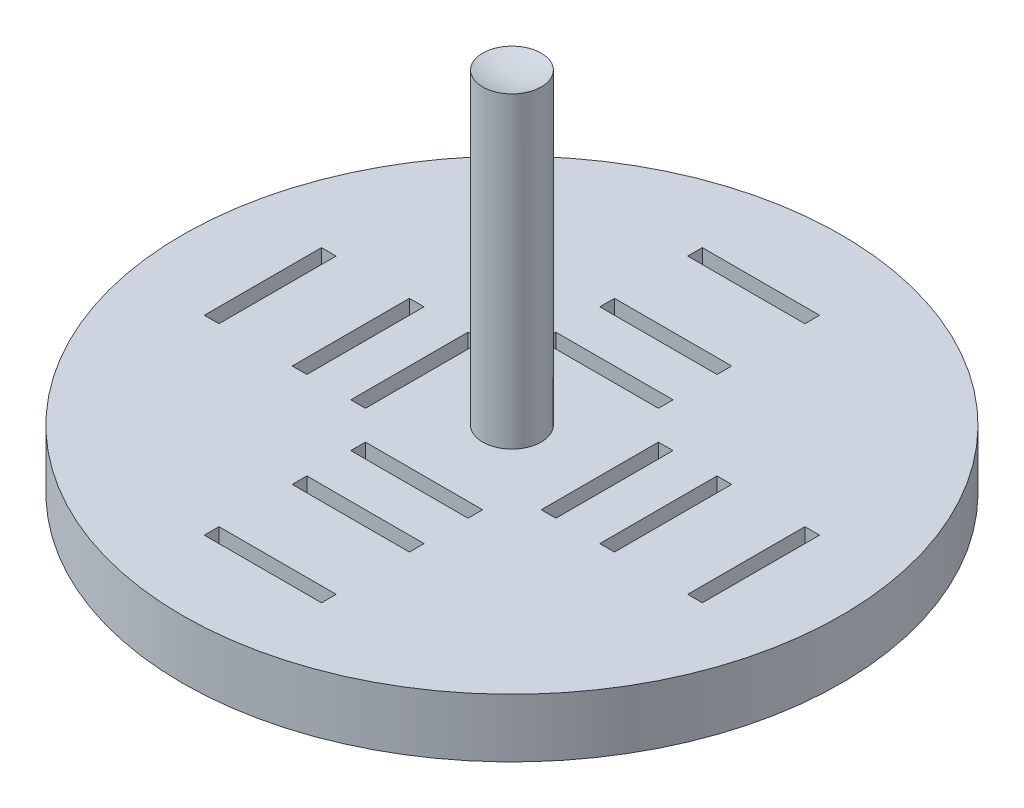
ISO-10303-21;
HEADER;
FILE_DESCRIPTION(('STEP AP214'),'2;1');
FILE_NAME('part.step','',(''),(''),'','','');
FILE_SCHEMA(('AUTOMOTIVE_DESIGN { 1 0 10303 214 1 1 1 1 }'));
ENDSEC;
DATA;
#1=APPLICATION_CONTEXT('core data for automotive mechanical design processes');
#2=APPLICATION_PROTOCOL_DEFINITION('international standard','automotive_design',2000,#1);
#3=PRODUCT_CONTEXT('',#1,'mechanical');
#4=PRODUCT('Part','Part','',(#3));
#5=PRODUCT_RELATED_PRODUCT_CATEGORY('part','',(#4));
#6=PRODUCT_DEFINITION_FORMATION('','',#4);
#7=PRODUCT_DEFINITION_CONTEXT('part definition',#1,'design');
#8=PRODUCT_DEFINITION('design','',#6,#7);
#9=PRODUCT_DEFINITION_SHAPE('','',#8);
#10=(LENGTH_UNIT() NAMED_UNIT(*) SI_UNIT(.MILLI.,.METRE.));
#11=(NAMED_UNIT(*) PLANE_ANGLE_UNIT() SI_UNIT($,.RADIAN.));
#12=(NAMED_UNIT(*) SI_UNIT($,.STERADIAN.) SOLID_ANGLE_UNIT());
#13=UNCERTAINTY_MEASURE_WITH_UNIT(LENGTH_MEASURE(1.E-05),#10,'distance_accuracy_value','');
#14=(GEOMETRIC_REPRESENTATION_CONTEXT(3) GLOBAL_UNCERTAINTY_ASSIGNED_CONTEXT((#13)) GLOBAL_UNIT_ASSIGNED_CONTEXT((#10,
#11,#12)) REPRESENTATION_CONTEXT('',''));
#15=CARTESIAN_POINT('',(0.,0.,0.));
#16=DIRECTION('',(0.,0.,1.));
#17=DIRECTION('',(1.,0.,0.));
#18=AXIS2_PLACEMENT_3D('',#15,#16,#17);
#19=CARTESIAN_POINT('',(0.,4.,0.));
#20=DIRECTION('',(0.,1.,0.));
#21=DIRECTION('',(0.,0.,1.));
#22=AXIS2_PLACEMENT_3D('',#19,#20,#21);
#23=PLANE('',#22);
#24=CARTESIAN_POINT('',(0.,4.,0.));
#25=DIRECTION('',(0.,1.,0.));
#26=DIRECTION('',(0.,0.,1.));
#27=AXIS2_PLACEMENT_3D('',#24,#25,#26);
#28=CIRCLE('',#27,2.);
#29=CARTESIAN_POINT('',(0.,4.,-2.));
#30=VERTEX_POINT('',#29);
#31=EDGE_CURVE('E369',#30,#30,#28,.T.);
#32=ORIENTED_EDGE('',*,*,#31,.F.);
#33=EDGE_LOOP('',(#32));
#34=FACE_BOUND('',#33,.T.);
#35=CARTESIAN_POINT('',(0.,4.,0.));
#36=DIRECTION('',(0.,1.,0.));
#37=DIRECTION('',(0.,0.,1.));
#38=AXIS2_PLACEMENT_3D('',#35,#36,#37);
#39=CIRCLE('',#38,22.5);
#40=CARTESIAN_POINT('',(0.,4.,22.5));
#41=VERTEX_POINT('',#40);
#42=EDGE_CURVE('E11',#41,#41,#39,.T.);
#43=ORIENTED_EDGE('',*,*,#42,.T.);
#44=EDGE_LOOP('',(#43));
#45=FACE_BOUND('',#44,.T.);
#46=DIRECTION('',(0.,0.,-1.));
#47=VECTOR('',#46,1.);
#48=CARTESIAN_POINT('',(4.,4.,11.));
#49=LINE('',#48,#47);
#50=CARTESIAN_POINT('',(4.,4.,11.));
#51=VERTEX_POINT('',#50);
#52=CARTESIAN_POINT('',(4.,4.,10.));
#53=VERTEX_POINT('',#52);
#54=EDGE_CURVE('E691',#51,#53,#49,.T.);
#55=ORIENTED_EDGE('',*,*,#54,.F.);
#56=DIRECTION('',(1.,0.,0.));
#57=VECTOR('',#56,1.);
#58=CARTESIAN_POINT('',(4.,4.,11.));
#59=LINE('',#58,#57);
#60=CARTESIAN_POINT('',(-4.,4.,11.));
#61=VERTEX_POINT('',#60);
#62=EDGE_CURVE('E689',#61,#51,#59,.T.);
#63=ORIENTED_EDGE('',*,*,#62,.F.);
#64=DIRECTION('',(0.,0.,1.));
#65=VECTOR('',#64,1.);
#66=CARTESIAN_POINT('',(-4.,4.,11.));
#67=LINE('',#66,#65);
#68=CARTESIAN_POINT('',(-4.,4.,10.));
#69=VERTEX_POINT('',#68);
#70=EDGE_CURVE('E697',#69,#61,#67,.T.);
#71=ORIENTED_EDGE('',*,*,#70,.F.);
#72=DIRECTION('',(-1.,0.,0.));
#73=VECTOR('',#72,1.);
#74=CARTESIAN_POINT('',(4.,4.,10.));
#75=LINE('',#74,#73);
#76=EDGE_CURVE('E694',#53,#69,#75,.T.);
#77=ORIENTED_EDGE('',*,*,#76,.F.);
#78=EDGE_LOOP('',(#55,#63,#71,#77));
#79=FACE_BOUND('',#78,.T.);
#80=DIRECTION('',(1.,0.,0.));
#81=VECTOR('',#80,1.);
#82=CARTESIAN_POINT('',(4.,4.,-10.));
#83=LINE('',#82,#81);
#84=CARTESIAN_POINT('',(-4.,4.,-10.));
#85=VERTEX_POINT('',#84);
#86=CARTESIAN_POINT('',(4.,4.,-10.));
#87=VERTEX_POINT('',#86);
#88=EDGE_CURVE('E660',#85,#87,#83,.T.);
#89=ORIENTED_EDGE('',*,*,#88,.F.);
#90=DIRECTION('',(0.,0.,1.));
#91=VECTOR('',#90,1.);
#92=CARTESIAN_POINT('',(-4.,4.,-11.));
#93=LINE('',#92,#91);
#94=CARTESIAN_POINT('',(-4.,4.,-11.));
#95=VERTEX_POINT('',#94);
#96=EDGE_CURVE('E658',#95,#85,#93,.T.);
#97=ORIENTED_EDGE('',*,*,#96,.F.);
#98=DIRECTION('',(-1.,0.,0.));
#99=VECTOR('',#98,1.);
#100=CARTESIAN_POINT('',(4.,4.,-11.));
#101=LINE('',#100,#99);
#102=CARTESIAN_POINT('',(4.,4.,-11.));
#103=VERTEX_POINT('',#102);
#104=EDGE_CURVE('E666',#103,#95,#101,.T.);
#105=ORIENTED_EDGE('',*,*,#104,.F.);
#106=DIRECTION('',(0.,0.,-1.));
#107=VECTOR('',#106,1.);
#108=CARTESIAN_POINT('',(4.,4.,-11.));
#109=LINE('',#108,#107);
#110=EDGE_CURVE('E663',#87,#103,#109,.T.);
#111=ORIENTED_EDGE('',*,*,#110,.F.);
#112=EDGE_LOOP('',(#89,#97,#105,#111));
#113=FACE_BOUND('',#112,.T.);
#114=DIRECTION('',(1.,0.,0.));
#115=VECTOR('',#114,1.);
#116=CARTESIAN_POINT('',(-11.,4.,4.));
#117=LINE('',#116,#115);
#118=CARTESIAN_POINT('',(-11.,4.,4.));
#119=VERTEX_POINT('',#118);
#120=CARTESIAN_POINT('',(-10.,4.,4.));
#121=VERTEX_POINT('',#120);
#122=EDGE_CURVE('E629',#119,#121,#117,.T.);
#123=ORIENTED_EDGE('',*,*,#122,.F.);
#124=DIRECTION('',(0.,0.,1.));
#125=VECTOR('',#124,1.);
#126=CARTESIAN_POINT('',(-11.,4.,-4.));
#127=LINE('',#126,#125);
#128=CARTESIAN_POINT('',(-11.,4.,-4.));
#129=VERTEX_POINT('',#128);
#130=EDGE_CURVE('E627',#129,#119,#127,.T.);
#131=ORIENTED_EDGE('',*,*,#130,.F.);
#132=DIRECTION('',(-1.,0.,0.));
#133=VECTOR('',#132,1.);
#134=CARTESIAN_POINT('',(-11.,4.,-4.));
#135=LINE('',#134,#133);
#136=CARTESIAN_POINT('',(-10.,4.,-4.));
#137=VERTEX_POINT('',#136);
#138=EDGE_CURVE('E635',#137,#129,#135,.T.);
#139=ORIENTED_EDGE('',*,*,#138,.F.);
#140=DIRECTION('',(0.,0.,-1.));
#141=VECTOR('',#140,1.);
#142=CARTESIAN_POINT('',(-10.,4.,-4.));
#143=LINE('',#142,#141);
#144=EDGE_CURVE('E632',#121,#137,#143,.T.);
#145=ORIENTED_EDGE('',*,*,#144,.F.);
#146=EDGE_LOOP('',(#123,#131,#139,#145));
#147=FACE_BOUND('',#146,.T.);
#148=DIRECTION('',(0.,0.,1.));
#149=VECTOR('',#148,1.);
#150=CARTESIAN_POINT('',(10.,4.,-4.));
#151=LINE('',#150,#149);
#152=CARTESIAN_POINT('',(10.,4.,-4.));
#153=VERTEX_POINT('',#152);
#154=CARTESIAN_POINT('',(10.,4.,4.));
#155=VERTEX_POINT('',#154);
#156=EDGE_CURVE('E598',#153,#155,#151,.T.);
#157=ORIENTED_EDGE('',*,*,#156,.F.);
#158=DIRECTION('',(-1.,0.,0.));
#159=VECTOR('',#158,1.);
#160=CARTESIAN_POINT('',(11.,4.,-4.));
#161=LINE('',#160,#159);
#162=CARTESIAN_POINT('',(11.,4.,-4.));
#163=VERTEX_POINT('',#162);
#164=EDGE_CURVE('E596',#163,#153,#161,.T.);
#165=ORIENTED_EDGE('',*,*,#164,.F.);
#166=DIRECTION('',(0.,0.,-1.));
#167=VECTOR('',#166,1.);
#168=CARTESIAN_POINT('',(11.,4.,-4.));
#169=LINE('',#168,#167);
#170=CARTESIAN_POINT('',(11.,4.,4.));
#171=VERTEX_POINT('',#170);
#172=EDGE_CURVE('E604',#171,#163,#169,.T.);
#173=ORIENTED_EDGE('',*,*,#172,.F.);
#174=DIRECTION('',(1.,0.,0.));
#175=VECTOR('',#174,1.);
#176=CARTESIAN_POINT('',(11.,4.,4.));
#177=LINE('',#176,#175);
#178=EDGE_CURVE('E601',#155,#171,#177,.T.);
#179=ORIENTED_EDGE('',*,*,#178,.F.);
#180=EDGE_LOOP('',(#157,#165,#173,#179));
#181=FACE_BOUND('',#180,.T.);
#182=DIRECTION('',(1.,0.,0.));
#183=VECTOR('',#182,1.);
#184=CARTESIAN_POINT('',(-4.,4.,-6.));
#185=LINE('',#184,#183);
#186=CARTESIAN_POINT('',(-4.,4.,-6.));
#187=VERTEX_POINT('',#186);
#188=CARTESIAN_POINT('',(4.,4.,-6.));
#189=VERTEX_POINT('',#188);
#190=EDGE_CURVE('E567',#187,#189,#185,.T.);
#191=ORIENTED_EDGE('',*,*,#190,.F.);
#192=DIRECTION('',(0.,0.,1.));
#193=VECTOR('',#192,1.);
#194=CARTESIAN_POINT('',(-4.,4.,-7.));
#195=LINE('',#194,#193);
#196=CARTESIAN_POINT('',(-4.,4.,-7.));
#197=VERTEX_POINT('',#196);
#198=EDGE_CURVE('E565',#197,#187,#195,.T.);
#199=ORIENTED_EDGE('',*,*,#198,.F.);
#200=DIRECTION('',(-1.,0.,0.));
#201=VECTOR('',#200,1.);
#202=CARTESIAN_POINT('',(-4.,4.,-7.));
#203=LINE('',#202,#201);
#204=CARTESIAN_POINT('',(4.,4.,-7.));
#205=VERTEX_POINT('',#204);
#206=EDGE_CURVE('E573',#205,#197,#203,.T.);
#207=ORIENTED_EDGE('',*,*,#206,.F.);
#208=DIRECTION('',(0.,0.,-1.));
#209=VECTOR('',#208,1.);
#210=CARTESIAN_POINT('',(4.,4.,-7.));
#211=LINE('',#210,#209);
#212=EDGE_CURVE('E570',#189,#205,#211,.T.);
#213=ORIENTED_EDGE('',*,*,#212,.F.);
#214=EDGE_LOOP('',(#191,#199,#207,#213));
#215=FACE_BOUND('',#214,.T.);
#216=DIRECTION('',(1.,0.,0.));
#217=VECTOR('',#216,1.);
#218=CARTESIAN_POINT('',(-4.,4.,-16.));
#219=LINE('',#218,#217);
#220=CARTESIAN_POINT('',(-4.,4.,-16.));
#221=VERTEX_POINT('',#220);
#222=CARTESIAN_POINT('',(4.,4.,-16.));
#223=VERTEX_POINT('',#222);
#224=EDGE_CURVE('E536',#221,#223,#219,.T.);
#225=ORIENTED_EDGE('',*,*,#224,.F.);
#226=DIRECTION('',(0.,0.,1.));
#227=VECTOR('',#226,1.);
#228=CARTESIAN_POINT('',(-4.,4.,-17.));
#229=LINE('',#228,#227);
#230=CARTESIAN_POINT('',(-4.,4.,-17.));
#231=VERTEX_POINT('',#230);
#232=EDGE_CURVE('E534',#231,#221,#229,.T.);
#233=ORIENTED_EDGE('',*,*,#232,.F.);
#234=DIRECTION('',(-1.,0.,0.));
#235=VECTOR('',#234,1.);
#236=CARTESIAN_POINT('',(-4.,4.,-17.));
#237=LINE('',#236,#235);
#238=CARTESIAN_POINT('',(4.,4.,-17.));
#239=VERTEX_POINT('',#238);
#240=EDGE_CURVE('E542',#239,#231,#237,.T.);
#241=ORIENTED_EDGE('',*,*,#240,.F.);
#242=DIRECTION('',(0.,0.,-1.));
#243=VECTOR('',#242,1.);
#244=CARTESIAN_POINT('',(4.,4.,-17.));
#245=LINE('',#244,#243);
#246=EDGE_CURVE('E539',#223,#239,#245,.T.);
#247=ORIENTED_EDGE('',*,*,#246,.F.);
#248=EDGE_LOOP('',(#225,#233,#241,#247));
#249=FACE_BOUND('',#248,.T.);
#250=DIRECTION('',(1.,0.,0.));
#251=VECTOR('',#250,1.);
#252=CARTESIAN_POINT('',(-17.,4.,4.));
#253=LINE('',#252,#251);
#254=CARTESIAN_POINT('',(-17.,4.,4.));
#255=VERTEX_POINT('',#254);
#256=CARTESIAN_POINT('',(-16.,4.,4.));
#257=VERTEX_POINT('',#256);
#258=EDGE_CURVE('E505',#255,#257,#253,.T.);
#259=ORIENTED_EDGE('',*,*,#258,.F.);
#260=DIRECTION('',(0.,0.,1.));
#261=VECTOR('',#260,1.);
#262=CARTESIAN_POINT('',(-17.,4.,-4.));
#263=LINE('',#262,#261);
#264=CARTESIAN_POINT('',(-17.,4.,-4.));
#265=VERTEX_POINT('',#264);
#266=EDGE_CURVE('E503',#265,#255,#263,.T.);
#267=ORIENTED_EDGE('',*,*,#266,.F.);
#268=DIRECTION('',(-1.,0.,0.));
#269=VECTOR('',#268,1.);
#270=CARTESIAN_POINT('',(-17.,4.,-4.));
#271=LINE('',#270,#269);
#272=CARTESIAN_POINT('',(-16.,4.,-4.));
#273=VERTEX_POINT('',#272);
#274=EDGE_CURVE('E511',#273,#265,#271,.T.);
#275=ORIENTED_EDGE('',*,*,#274,.F.);
#276=DIRECTION('',(0.,0.,-1.));
#277=VECTOR('',#276,1.);
#278=CARTESIAN_POINT('',(-16.,4.,-4.));
#279=LINE('',#278,#277);
#280=EDGE_CURVE('E508',#257,#273,#279,.T.);
#281=ORIENTED_EDGE('',*,*,#280,.F.);
#282=EDGE_LOOP('',(#259,#267,#275,#281));
#283=FACE_BOUND('',#282,.T.);
#284=DIRECTION('',(1.,0.,0.));
#285=VECTOR('',#284,1.);
#286=CARTESIAN_POINT('',(-7.,4.,4.));
#287=LINE('',#286,#285);
#288=CARTESIAN_POINT('',(-7.,4.,4.));
#289=VERTEX_POINT('',#288);
#290=CARTESIAN_POINT('',(-6.,4.,4.));
#291=VERTEX_POINT('',#290);
#292=EDGE_CURVE('E474',#289,#291,#287,.T.);
#293=ORIENTED_EDGE('',*,*,#292,.F.);
#294=DIRECTION('',(0.,0.,1.));
#295=VECTOR('',#294,1.);
#296=CARTESIAN_POINT('',(-7.,4.,-4.));
#297=LINE('',#296,#295);
#298=CARTESIAN_POINT('',(-7.,4.,-4.));
#299=VERTEX_POINT('',#298);
#300=EDGE_CURVE('E472',#299,#289,#297,.T.);
#301=ORIENTED_EDGE('',*,*,#300,.F.);
#302=DIRECTION('',(-1.,0.,0.));
#303=VECTOR('',#302,1.);
#304=CARTESIAN_POINT('',(-7.,4.,-4.));
#305=LINE('',#304,#303);
#306=CARTESIAN_POINT('',(-6.,4.,-4.));
#307=VERTEX_POINT('',#306);
#308=EDGE_CURVE('E480',#307,#299,#305,.T.);
#309=ORIENTED_EDGE('',*,*,#308,.F.);
#310=DIRECTION('',(0.,0.,-1.));
#311=VECTOR('',#310,1.);
#312=CARTESIAN_POINT('',(-6.,4.,-4.));
#313=LINE('',#312,#311);
#314=EDGE_CURVE('E477',#291,#307,#313,.T.);
#315=ORIENTED_EDGE('',*,*,#314,.F.);
#316=EDGE_LOOP('',(#293,#301,#309,#315));
#317=FACE_BOUND('',#316,.T.);
#318=DIRECTION('',(1.,0.,0.));
#319=VECTOR('',#318,1.);
#320=CARTESIAN_POINT('',(-4.,4.,7.));
#321=LINE('',#320,#319);
#322=CARTESIAN_POINT('',(-4.,4.,7.));
#323=VERTEX_POINT('',#322);
#324=CARTESIAN_POINT('',(4.,4.,7.));
#325=VERTEX_POINT('',#324);
#326=EDGE_CURVE('E443',#323,#325,#321,.T.);
#327=ORIENTED_EDGE('',*,*,#326,.F.);
#328=DIRECTION('',(0.,0.,1.));
#329=VECTOR('',#328,1.);
#330=CARTESIAN_POINT('',(-4.,4.,7.));
#331=LINE('',#330,#329);
#332=CARTESIAN_POINT('',(-4.,4.,6.));
#333=VERTEX_POINT('',#332);
#334=EDGE_CURVE('E441',#333,#323,#331,.T.);
#335=ORIENTED_EDGE('',*,*,#334,.F.);
#336=DIRECTION('',(-1.,0.,0.));
#337=VECTOR('',#336,1.);
#338=CARTESIAN_POINT('',(-4.,4.,6.));
#339=LINE('',#338,#337);
#340=CARTESIAN_POINT('',(4.,4.,6.));
#341=VERTEX_POINT('',#340);
#342=EDGE_CURVE('E449',#341,#333,#339,.T.);
#343=ORIENTED_EDGE('',*,*,#342,.F.);
#344=DIRECTION('',(0.,0.,-1.));
#345=VECTOR('',#344,1.);
#346=CARTESIAN_POINT('',(4.,4.,7.));
#347=LINE('',#346,#345);
#348=EDGE_CURVE('E446',#325,#341,#347,.T.);
#349=ORIENTED_EDGE('',*,*,#348,.F.);
#350=EDGE_LOOP('',(#327,#335,#343,#349));
#351=FACE_BOUND('',#350,.T.);
#352=DIRECTION('',(1.,0.,0.));
#353=VECTOR('',#352,1.);
#354=CARTESIAN_POINT('',(-4.,4.,17.));
#355=LINE('',#354,#353);
#356=CARTESIAN_POINT('',(-4.,4.,17.));
#357=VERTEX_POINT('',#356);
#358=CARTESIAN_POINT('',(4.,4.,17.));
#359=VERTEX_POINT('',#358);
#360=EDGE_CURVE('E412',#357,#359,#355,.T.);
#361=ORIENTED_EDGE('',*,*,#360,.F.);
#362=DIRECTION('',(0.,0.,1.));
#363=VECTOR('',#362,1.);
#364=CARTESIAN_POINT('',(-4.,4.,17.));
#365=LINE('',#364,#363);
#366=CARTESIAN_POINT('',(-4.,4.,16.));
#367=VERTEX_POINT('',#366);
#368=EDGE_CURVE('E410',#367,#357,#365,.T.);
#369=ORIENTED_EDGE('',*,*,#368,.F.);
#370=DIRECTION('',(-1.,0.,0.));
#371=VECTOR('',#370,1.);
#372=CARTESIAN_POINT('',(-4.,4.,16.));
#373=LINE('',#372,#371);
#374=CARTESIAN_POINT('',(4.,4.,16.));
#375=VERTEX_POINT('',#374);
#376=EDGE_CURVE('E418',#375,#367,#373,.T.);
#377=ORIENTED_EDGE('',*,*,#376,.F.);
#378=DIRECTION('',(0.,0.,-1.));
#379=VECTOR('',#378,1.);
#380=CARTESIAN_POINT('',(4.,4.,17.));
#381=LINE('',#380,#379);
#382=EDGE_CURVE('E415',#359,#375,#381,.T.);
#383=ORIENTED_EDGE('',*,*,#382,.F.);
#384=EDGE_LOOP('',(#361,#369,#377,#383));
#385=FACE_BOUND('',#384,.T.);
#386=DIRECTION('',(-1.,0.,0.));
#387=VECTOR('',#386,1.);
#388=CARTESIAN_POINT('',(7.,4.,-4.));
#389=LINE('',#388,#387);
#390=CARTESIAN_POINT('',(7.,4.,-4.));
#391=VERTEX_POINT('',#390);
#392=CARTESIAN_POINT('',(6.,4.,-4.));
#393=VERTEX_POINT('',#392);
#394=EDGE_CURVE('E381',#391,#393,#389,.T.);
#395=ORIENTED_EDGE('',*,*,#394,.F.);
#396=DIRECTION('',(0.,0.,-1.));
#397=VECTOR('',#396,1.);
#398=CARTESIAN_POINT('',(7.,4.,-4.));
#399=LINE('',#398,#397);
#400=CARTESIAN_POINT('',(7.,4.,4.));
#401=VERTEX_POINT('',#400);
#402=EDGE_CURVE('E379',#401,#391,#399,.T.);
#403=ORIENTED_EDGE('',*,*,#402,.F.);
#404=DIRECTION('',(1.,0.,0.));
#405=VECTOR('',#404,1.);
#406=CARTESIAN_POINT('',(7.,4.,4.));
#407=LINE('',#406,#405);
#408=CARTESIAN_POINT('',(6.,4.,4.));
#409=VERTEX_POINT('',#408);
#410=EDGE_CURVE('E387',#409,#401,#407,.T.);
#411=ORIENTED_EDGE('',*,*,#410,.F.);
#412=DIRECTION('',(0.,0.,1.));
#413=VECTOR('',#412,1.);
#414=CARTESIAN_POINT('',(6.,4.,-4.));
#415=LINE('',#414,#413);
#416=EDGE_CURVE('E384',#393,#409,#415,.T.);
#417=ORIENTED_EDGE('',*,*,#416,.F.);
#418=EDGE_LOOP('',(#395,#403,#411,#417));
#419=FACE_BOUND('',#418,.T.);
#420=DIRECTION('',(-1.,0.,0.));
#421=VECTOR('',#420,1.);
#422=CARTESIAN_POINT('',(17.,4.,-4.));
#423=LINE('',#422,#421);
#424=CARTESIAN_POINT('',(17.,4.,-4.));
#425=VERTEX_POINT('',#424);
#426=CARTESIAN_POINT('',(16.,4.,-4.));
#427=VERTEX_POINT('',#426);
#428=EDGE_CURVE('E349',#425,#427,#423,.T.);
#429=ORIENTED_EDGE('',*,*,#428,.F.);
#430=DIRECTION('',(0.,0.,-1.));
#431=VECTOR('',#430,1.);
#432=CARTESIAN_POINT('',(17.,4.,-4.));
#433=LINE('',#432,#431);
#434=CARTESIAN_POINT('',(17.,4.,4.));
#435=VERTEX_POINT('',#434);
#436=EDGE_CURVE('E341',#435,#425,#433,.T.);
#437=ORIENTED_EDGE('',*,*,#436,.F.);
#438=DIRECTION('',(1.,0.,0.));
#439=VECTOR('',#438,1.);
#440=CARTESIAN_POINT('',(17.,4.,4.));
#441=LINE('',#440,#439);
#442=CARTESIAN_POINT('',(16.,4.,4.));
#443=VERTEX_POINT('',#442);
#444=EDGE_CURVE('E363',#443,#435,#441,.T.);
#445=ORIENTED_EDGE('',*,*,#444,.F.);
#446=DIRECTION('',(0.,0.,1.));
#447=VECTOR('',#446,1.);
#448=CARTESIAN_POINT('',(16.,4.,-4.));
#449=LINE('',#448,#447);
#450=EDGE_CURVE('E361',#427,#443,#449,.T.);
#451=ORIENTED_EDGE('',*,*,#450,.F.);
#452=EDGE_LOOP('',(#429,#437,#445,#451));
#453=FACE_BOUND('',#452,.T.);
#454=ADVANCED_FACE('F36',(#34,#45,#79,#113,#147,#181,#215,#249,#283,#317,#351,#385,#419,#453),
#23,.T.);
#455=CARTESIAN_POINT('',(0.,0.,0.));
#456=DIRECTION('',(0.,1.,0.));
#457=DIRECTION('',(0.,0.,1.));
#458=AXIS2_PLACEMENT_3D('',#455,#456,#457);
#459=PLANE('',#458);
#460=DIRECTION('',(0.,0.,-1.));
#461=VECTOR('',#460,1.);
#462=CARTESIAN_POINT('',(7.,0.,-4.));
#463=LINE('',#462,#461);
#464=CARTESIAN_POINT('',(7.,0.,4.));
#465=VERTEX_POINT('',#464);
#466=CARTESIAN_POINT('',(7.,0.,-4.));
#467=VERTEX_POINT('',#466);
#468=EDGE_CURVE('E357',#465,#467,#463,.T.);
#469=ORIENTED_EDGE('',*,*,#468,.T.);
#470=DIRECTION('',(-1.,0.,0.));
#471=VECTOR('',#470,1.);
#472=CARTESIAN_POINT('',(7.,0.,-4.));
#473=LINE('',#472,#471);
#474=CARTESIAN_POINT('',(6.,0.,-4.));
#475=VERTEX_POINT('',#474);
#476=EDGE_CURVE('E392',#467,#475,#473,.T.);
#477=ORIENTED_EDGE('',*,*,#476,.T.);
#478=DIRECTION('',(0.,0.,1.));
#479=VECTOR('',#478,1.);
#480=CARTESIAN_POINT('',(6.,0.,-4.));
#481=LINE('',#480,#479);
#482=CARTESIAN_POINT('',(6.,0.,4.));
#483=VERTEX_POINT('',#482);
#484=EDGE_CURVE('E395',#475,#483,#481,.T.);
#485=ORIENTED_EDGE('',*,*,#484,.T.);
#486=DIRECTION('',(1.,0.,0.));
#487=VECTOR('',#486,1.);
#488=CARTESIAN_POINT('',(7.,0.,4.));
#489=LINE('',#488,#487);
#490=EDGE_CURVE('E382',#483,#465,#489,.T.);
#491=ORIENTED_EDGE('',*,*,#490,.T.);
#492=EDGE_LOOP('',(#469,#477,#485,#491));
#493=FACE_BOUND('',#492,.T.);
#494=DIRECTION('',(0.,0.,1.));
#495=VECTOR('',#494,1.);
#496=CARTESIAN_POINT('',(-4.,0.,7.));
#497=LINE('',#496,#495);
#498=CARTESIAN_POINT('',(-4.,0.,6.));
#499=VERTEX_POINT('',#498);
#500=CARTESIAN_POINT('',(-4.,0.,7.));
#501=VERTEX_POINT('',#500);
#502=EDGE_CURVE('E440',#499,#501,#497,.T.);
#503=ORIENTED_EDGE('',*,*,#502,.T.);
#504=DIRECTION('',(1.,0.,0.));
#505=VECTOR('',#504,1.);
#506=CARTESIAN_POINT('',(-4.,0.,7.));
#507=LINE('',#506,#505);
#508=CARTESIAN_POINT('',(4.,0.,7.));
#509=VERTEX_POINT('',#508);
#510=EDGE_CURVE('E454',#501,#509,#507,.T.);
#511=ORIENTED_EDGE('',*,*,#510,.T.);
#512=DIRECTION('',(0.,0.,-1.));
#513=VECTOR('',#512,1.);
#514=CARTESIAN_POINT('',(4.,0.,7.));
#515=LINE('',#514,#513);
#516=CARTESIAN_POINT('',(4.,0.,6.));
#517=VERTEX_POINT('',#516);
#518=EDGE_CURVE('E457',#509,#517,#515,.T.);
#519=ORIENTED_EDGE('',*,*,#518,.T.);
#520=DIRECTION('',(-1.,0.,0.));
#521=VECTOR('',#520,1.);
#522=CARTESIAN_POINT('',(-4.,0.,6.));
#523=LINE('',#522,#521);
#524=EDGE_CURVE('E444',#517,#499,#523,.T.);
#525=ORIENTED_EDGE('',*,*,#524,.T.);
#526=EDGE_LOOP('',(#503,#511,#519,#525));
#527=FACE_BOUND('',#526,.T.);
#528=DIRECTION('',(0.,0.,1.));
#529=VECTOR('',#528,1.);
#530=CARTESIAN_POINT('',(-17.,0.,-4.));
#531=LINE('',#530,#529);
#532=CARTESIAN_POINT('',(-17.,0.,-4.));
#533=VERTEX_POINT('',#532);
#534=CARTESIAN_POINT('',(-17.,0.,4.));
#535=VERTEX_POINT('',#534);
#536=EDGE_CURVE('E502',#533,#535,#531,.T.);
#537=ORIENTED_EDGE('',*,*,#536,.T.);
#538=DIRECTION('',(1.,0.,0.));
#539=VECTOR('',#538,1.);
#540=CARTESIAN_POINT('',(-17.,0.,4.));
#541=LINE('',#540,#539);
#542=CARTESIAN_POINT('',(-16.,0.,4.));
#543=VERTEX_POINT('',#542);
#544=EDGE_CURVE('E516',#535,#543,#541,.T.);
#545=ORIENTED_EDGE('',*,*,#544,.T.);
#546=DIRECTION('',(0.,0.,-1.));
#547=VECTOR('',#546,1.);
#548=CARTESIAN_POINT('',(-16.,0.,-4.));
#549=LINE('',#548,#547);
#550=CARTESIAN_POINT('',(-16.,0.,-4.));
#551=VERTEX_POINT('',#550);
#552=EDGE_CURVE('E519',#543,#551,#549,.T.);
#553=ORIENTED_EDGE('',*,*,#552,.T.);
#554=DIRECTION('',(-1.,0.,0.));
#555=VECTOR('',#554,1.);
#556=CARTESIAN_POINT('',(-17.,0.,-4.));
#557=LINE('',#556,#555);
#558=EDGE_CURVE('E506',#551,#533,#557,.T.);
#559=ORIENTED_EDGE('',*,*,#558,.T.);
#560=EDGE_LOOP('',(#537,#545,#553,#559));
#561=FACE_BOUND('',#560,.T.);
#562=DIRECTION('',(0.,0.,1.));
#563=VECTOR('',#562,1.);
#564=CARTESIAN_POINT('',(-4.,0.,-7.));
#565=LINE('',#564,#563);
#566=CARTESIAN_POINT('',(-4.,0.,-7.));
#567=VERTEX_POINT('',#566);
#568=CARTESIAN_POINT('',(-4.,0.,-6.));
#569=VERTEX_POINT('',#568);
#570=EDGE_CURVE('E564',#567,#569,#565,.T.);
#571=ORIENTED_EDGE('',*,*,#570,.T.);
#572=DIRECTION('',(1.,0.,0.));
#573=VECTOR('',#572,1.);
#574=CARTESIAN_POINT('',(-4.,0.,-6.));
#575=LINE('',#574,#573);
#576=CARTESIAN_POINT('',(4.,0.,-6.));
#577=VERTEX_POINT('',#576);
#578=EDGE_CURVE('E578',#569,#577,#575,.T.);
#579=ORIENTED_EDGE('',*,*,#578,.T.);
#580=DIRECTION('',(0.,0.,-1.));
#581=VECTOR('',#580,1.);
#582=CARTESIAN_POINT('',(4.,0.,-7.));
#583=LINE('',#582,#581);
#584=CARTESIAN_POINT('',(4.,0.,-7.));
#585=VERTEX_POINT('',#584);
#586=EDGE_CURVE('E581',#577,#585,#583,.T.);
#587=ORIENTED_EDGE('',*,*,#586,.T.);
#588=DIRECTION('',(-1.,0.,0.));
#589=VECTOR('',#588,1.);
#590=CARTESIAN_POINT('',(-4.,0.,-7.));
#591=LINE('',#590,#589);
#592=EDGE_CURVE('E568',#585,#567,#591,.T.);
#593=ORIENTED_EDGE('',*,*,#592,.T.);
#594=EDGE_LOOP('',(#571,#579,#587,#593));
#595=FACE_BOUND('',#594,.T.);
#596=DIRECTION('',(0.,0.,1.));
#597=VECTOR('',#596,1.);
#598=CARTESIAN_POINT('',(-11.,0.,-4.));
#599=LINE('',#598,#597);
#600=CARTESIAN_POINT('',(-11.,0.,-4.));
#601=VERTEX_POINT('',#600);
#602=CARTESIAN_POINT('',(-11.,0.,4.));
#603=VERTEX_POINT('',#602);
#604=EDGE_CURVE('E626',#601,#603,#599,.T.);
#605=ORIENTED_EDGE('',*,*,#604,.T.);
#606=DIRECTION('',(1.,0.,0.));
#607=VECTOR('',#606,1.);
#608=CARTESIAN_POINT('',(-11.,0.,4.));
#609=LINE('',#608,#607);
#610=CARTESIAN_POINT('',(-10.,0.,4.));
#611=VERTEX_POINT('',#610);
#612=EDGE_CURVE('E640',#603,#611,#609,.T.);
#613=ORIENTED_EDGE('',*,*,#612,.T.);
#614=DIRECTION('',(0.,0.,-1.));
#615=VECTOR('',#614,1.);
#616=CARTESIAN_POINT('',(-10.,0.,-4.));
#617=LINE('',#616,#615);
#618=CARTESIAN_POINT('',(-10.,0.,-4.));
#619=VERTEX_POINT('',#618);
#620=EDGE_CURVE('E643',#611,#619,#617,.T.);
#621=ORIENTED_EDGE('',*,*,#620,.T.);
#622=DIRECTION('',(-1.,0.,0.));
#623=VECTOR('',#622,1.);
#624=CARTESIAN_POINT('',(-11.,0.,-4.));
#625=LINE('',#624,#623);
#626=EDGE_CURVE('E630',#619,#601,#625,.T.);
#627=ORIENTED_EDGE('',*,*,#626,.T.);
#628=EDGE_LOOP('',(#605,#613,#621,#627));
#629=FACE_BOUND('',#628,.T.);
#630=DIRECTION('',(1.,0.,0.));
#631=VECTOR('',#630,1.);
#632=CARTESIAN_POINT('',(4.,0.,11.));
#633=LINE('',#632,#631);
#634=CARTESIAN_POINT('',(-4.,0.,11.));
#635=VERTEX_POINT('',#634);
#636=CARTESIAN_POINT('',(4.,0.,11.));
#637=VERTEX_POINT('',#636);
#638=EDGE_CURVE('E688',#635,#637,#633,.T.);
#639=ORIENTED_EDGE('',*,*,#638,.T.);
#640=DIRECTION('',(0.,0.,-1.));
#641=VECTOR('',#640,1.);
#642=CARTESIAN_POINT('',(4.,0.,11.));
#643=LINE('',#642,#641);
#644=CARTESIAN_POINT('',(4.,0.,10.));
#645=VERTEX_POINT('',#644);
#646=EDGE_CURVE('E702',#637,#645,#643,.T.);
#647=ORIENTED_EDGE('',*,*,#646,.T.);
#648=DIRECTION('',(-1.,0.,0.));
#649=VECTOR('',#648,1.);
#650=CARTESIAN_POINT('',(4.,0.,10.));
#651=LINE('',#650,#649);
#652=CARTESIAN_POINT('',(-4.,0.,10.));
#653=VERTEX_POINT('',#652);
#654=EDGE_CURVE('E705',#645,#653,#651,.T.);
#655=ORIENTED_EDGE('',*,*,#654,.T.);
#656=DIRECTION('',(0.,0.,1.));
#657=VECTOR('',#656,1.);
#658=CARTESIAN_POINT('',(-4.,0.,11.));
#659=LINE('',#658,#657);
#660=EDGE_CURVE('E692',#653,#635,#659,.T.);
#661=ORIENTED_EDGE('',*,*,#660,.T.);
#662=EDGE_LOOP('',(#639,#647,#655,#661));
#663=FACE_BOUND('',#662,.T.);
#664=CARTESIAN_POINT('',(0.,0.,0.));
#665=DIRECTION('',(0.,1.,0.));
#666=DIRECTION('',(0.,0.,1.));
#667=AXIS2_PLACEMENT_3D('',#664,#665,#666);
#668=CIRCLE('',#667,22.5);
#669=CARTESIAN_POINT('',(0.,0.,22.5));
#670=VERTEX_POINT('',#669);
#671=EDGE_CURVE('E40',#670,#670,#668,.T.);
#672=ORIENTED_EDGE('',*,*,#671,.F.);
#673=EDGE_LOOP('',(#672));
#674=FACE_BOUND('',#673,.T.);
#675=DIRECTION('',(0.,0.,1.));
#676=VECTOR('',#675,1.);
#677=CARTESIAN_POINT('',(-4.,0.,-11.));
#678=LINE('',#677,#676);
#679=CARTESIAN_POINT('',(-4.,0.,-11.));
#680=VERTEX_POINT('',#679);
#681=CARTESIAN_POINT('',(-4.,0.,-10.));
#682=VERTEX_POINT('',#681);
#683=EDGE_CURVE('E657',#680,#682,#678,.T.);
#684=ORIENTED_EDGE('',*,*,#683,.T.);
#685=DIRECTION('',(1.,0.,0.));
#686=VECTOR('',#685,1.);
#687=CARTESIAN_POINT('',(4.,0.,-10.));
#688=LINE('',#687,#686);
#689=CARTESIAN_POINT('',(4.,0.,-10.));
#690=VERTEX_POINT('',#689);
#691=EDGE_CURVE('E671',#682,#690,#688,.T.);
#692=ORIENTED_EDGE('',*,*,#691,.T.);
#693=DIRECTION('',(0.,0.,-1.));
#694=VECTOR('',#693,1.);
#695=CARTESIAN_POINT('',(4.,0.,-11.));
#696=LINE('',#695,#694);
#697=CARTESIAN_POINT('',(4.,0.,-11.));
#698=VERTEX_POINT('',#697);
#699=EDGE_CURVE('E674',#690,#698,#696,.T.);
#700=ORIENTED_EDGE('',*,*,#699,.T.);
#701=DIRECTION('',(-1.,0.,0.));
#702=VECTOR('',#701,1.);
#703=CARTESIAN_POINT('',(4.,0.,-11.));
#704=LINE('',#703,#702);
#705=EDGE_CURVE('E661',#698,#680,#704,.T.);
#706=ORIENTED_EDGE('',*,*,#705,.T.);
#707=EDGE_LOOP('',(#684,#692,#700,#706));
#708=FACE_BOUND('',#707,.T.);
#709=DIRECTION('',(-1.,0.,0.));
#710=VECTOR('',#709,1.);
#711=CARTESIAN_POINT('',(11.,0.,-4.));
#712=LINE('',#711,#710);
#713=CARTESIAN_POINT('',(11.,0.,-4.));
#714=VERTEX_POINT('',#713);
#715=CARTESIAN_POINT('',(10.,0.,-4.));
#716=VERTEX_POINT('',#715);
#717=EDGE_CURVE('E595',#714,#716,#712,.T.);
#718=ORIENTED_EDGE('',*,*,#717,.T.);
#719=DIRECTION('',(0.,0.,1.));
#720=VECTOR('',#719,1.);
#721=CARTESIAN_POINT('',(10.,0.,-4.));
#722=LINE('',#721,#720);
#723=CARTESIAN_POINT('',(10.,0.,4.));
#724=VERTEX_POINT('',#723);
#725=EDGE_CURVE('E609',#716,#724,#722,.T.);
#726=ORIENTED_EDGE('',*,*,#725,.T.);
#727=DIRECTION('',(1.,0.,0.));
#728=VECTOR('',#727,1.);
#729=CARTESIAN_POINT('',(11.,0.,4.));
#730=LINE('',#729,#728);
#731=CARTESIAN_POINT('',(11.,0.,4.));
#732=VERTEX_POINT('',#731);
#733=EDGE_CURVE('E612',#724,#732,#730,.T.);
#734=ORIENTED_EDGE('',*,*,#733,.T.);
#735=DIRECTION('',(0.,0.,-1.));
#736=VECTOR('',#735,1.);
#737=CARTESIAN_POINT('',(11.,0.,-4.));
#738=LINE('',#737,#736);
#739=EDGE_CURVE('E599',#732,#714,#738,.T.);
#740=ORIENTED_EDGE('',*,*,#739,.T.);
#741=EDGE_LOOP('',(#718,#726,#734,#740));
#742=FACE_BOUND('',#741,.T.);
#743=DIRECTION('',(0.,0.,1.));
#744=VECTOR('',#743,1.);
#745=CARTESIAN_POINT('',(-4.,0.,-17.));
#746=LINE('',#745,#744);
#747=CARTESIAN_POINT('',(-4.,0.,-17.));
#748=VERTEX_POINT('',#747);
#749=CARTESIAN_POINT('',(-4.,0.,-16.));
#750=VERTEX_POINT('',#749);
#751=EDGE_CURVE('E533',#748,#750,#746,.T.);
#752=ORIENTED_EDGE('',*,*,#751,.T.);
#753=DIRECTION('',(1.,0.,0.));
#754=VECTOR('',#753,1.);
#755=CARTESIAN_POINT('',(-4.,0.,-16.));
#756=LINE('',#755,#754);
#757=CARTESIAN_POINT('',(4.,0.,-16.));
#758=VERTEX_POINT('',#757);
#759=EDGE_CURVE('E547',#750,#758,#756,.T.);
#760=ORIENTED_EDGE('',*,*,#759,.T.);
#761=DIRECTION('',(0.,0.,-1.));
#762=VECTOR('',#761,1.);
#763=CARTESIAN_POINT('',(4.,0.,-17.));
#764=LINE('',#763,#762);
#765=CARTESIAN_POINT('',(4.,0.,-17.));
#766=VERTEX_POINT('',#765);
#767=EDGE_CURVE('E550',#758,#766,#764,.T.);
#768=ORIENTED_EDGE('',*,*,#767,.T.);
#769=DIRECTION('',(-1.,0.,0.));
#770=VECTOR('',#769,1.);
#771=CARTESIAN_POINT('',(-4.,0.,-17.));
#772=LINE('',#771,#770);
#773=EDGE_CURVE('E537',#766,#748,#772,.T.);
#774=ORIENTED_EDGE('',*,*,#773,.T.);
#775=EDGE_LOOP('',(#752,#760,#768,#774));
#776=FACE_BOUND('',#775,.T.);
#777=DIRECTION('',(0.,0.,1.));
#778=VECTOR('',#777,1.);
#779=CARTESIAN_POINT('',(-7.,0.,-4.));
#780=LINE('',#779,#778);
#781=CARTESIAN_POINT('',(-7.,0.,-4.));
#782=VERTEX_POINT('',#781);
#783=CARTESIAN_POINT('',(-7.,0.,4.));
#784=VERTEX_POINT('',#783);
#785=EDGE_CURVE('E471',#782,#784,#780,.T.);
#786=ORIENTED_EDGE('',*,*,#785,.T.);
#787=DIRECTION('',(1.,0.,0.));
#788=VECTOR('',#787,1.);
#789=CARTESIAN_POINT('',(-7.,0.,4.));
#790=LINE('',#789,#788);
#791=CARTESIAN_POINT('',(-6.,0.,4.));
#792=VERTEX_POINT('',#791);
#793=EDGE_CURVE('E485',#784,#792,#790,.T.);
#794=ORIENTED_EDGE('',*,*,#793,.T.);
#795=DIRECTION('',(0.,0.,-1.));
#796=VECTOR('',#795,1.);
#797=CARTESIAN_POINT('',(-6.,0.,-4.));
#798=LINE('',#797,#796);
#799=CARTESIAN_POINT('',(-6.,0.,-4.));
#800=VERTEX_POINT('',#799);
#801=EDGE_CURVE('E488',#792,#800,#798,.T.);
#802=ORIENTED_EDGE('',*,*,#801,.T.);
#803=DIRECTION('',(-1.,0.,0.));
#804=VECTOR('',#803,1.);
#805=CARTESIAN_POINT('',(-7.,0.,-4.));
#806=LINE('',#805,#804);
#807=EDGE_CURVE('E475',#800,#782,#806,.T.);
#808=ORIENTED_EDGE('',*,*,#807,.T.);
#809=EDGE_LOOP('',(#786,#794,#802,#808));
#810=FACE_BOUND('',#809,.T.);
#811=DIRECTION('',(0.,0.,1.));
#812=VECTOR('',#811,1.);
#813=CARTESIAN_POINT('',(-4.,0.,17.));
#814=LINE('',#813,#812);
#815=CARTESIAN_POINT('',(-4.,0.,16.));
#816=VERTEX_POINT('',#815);
#817=CARTESIAN_POINT('',(-4.,0.,17.));
#818=VERTEX_POINT('',#817);
#819=EDGE_CURVE('E409',#816,#818,#814,.T.);
#820=ORIENTED_EDGE('',*,*,#819,.T.);
#821=DIRECTION('',(1.,0.,0.));
#822=VECTOR('',#821,1.);
#823=CARTESIAN_POINT('',(-4.,0.,17.));
#824=LINE('',#823,#822);
#825=CARTESIAN_POINT('',(4.,0.,17.));
#826=VERTEX_POINT('',#825);
#827=EDGE_CURVE('E423',#818,#826,#824,.T.);
#828=ORIENTED_EDGE('',*,*,#827,.T.);
#829=DIRECTION('',(0.,0.,-1.));
#830=VECTOR('',#829,1.);
#831=CARTESIAN_POINT('',(4.,0.,17.));
#832=LINE('',#831,#830);
#833=CARTESIAN_POINT('',(4.,0.,16.));
#834=VERTEX_POINT('',#833);
#835=EDGE_CURVE('E426',#826,#834,#832,.T.);
#836=ORIENTED_EDGE('',*,*,#835,.T.);
#837=DIRECTION('',(-1.,0.,0.));
#838=VECTOR('',#837,1.);
#839=CARTESIAN_POINT('',(-4.,0.,16.));
#840=LINE('',#839,#838);
#841=EDGE_CURVE('E413',#834,#816,#840,.T.);
#842=ORIENTED_EDGE('',*,*,#841,.T.);
#843=EDGE_LOOP('',(#820,#828,#836,#842));
#844=FACE_BOUND('',#843,.T.);
#845=DIRECTION('',(0.,0.,-1.));
#846=VECTOR('',#845,1.);
#847=CARTESIAN_POINT('',(17.,0.,-4.));
#848=LINE('',#847,#846);
#849=CARTESIAN_POINT('',(17.,0.,4.));
#850=VERTEX_POINT('',#849);
#851=CARTESIAN_POINT('',(17.,0.,-4.));
#852=VERTEX_POINT('',#851);
#853=EDGE_CURVE('E59',#850,#852,#848,.T.);
#854=ORIENTED_EDGE('',*,*,#853,.T.);
#855=DIRECTION('',(-1.,0.,0.));
#856=VECTOR('',#855,1.);
#857=CARTESIAN_POINT('',(17.,0.,-4.));
#858=LINE('',#857,#856);
#859=CARTESIAN_POINT('',(16.,0.,-4.));
#860=VERTEX_POINT('',#859);
#861=EDGE_CURVE('E356',#852,#860,#858,.T.);
#862=ORIENTED_EDGE('',*,*,#861,.T.);
#863=DIRECTION('',(0.,0.,1.));
#864=VECTOR('',#863,1.);
#865=CARTESIAN_POINT('',(16.,0.,-4.));
#866=LINE('',#865,#864);
#867=CARTESIAN_POINT('',(16.,0.,4.));
#868=VERTEX_POINT('',#867);
#869=EDGE_CURVE('E371',#860,#868,#866,.T.);
#870=ORIENTED_EDGE('',*,*,#869,.T.);
#871=DIRECTION('',(1.,0.,0.));
#872=VECTOR('',#871,1.);
#873=CARTESIAN_POINT('',(17.,0.,4.));
#874=LINE('',#873,#872);
#875=EDGE_CURVE('E350',#868,#850,#874,.T.);
#876=ORIENTED_EDGE('',*,*,#875,.T.);
#877=EDGE_LOOP('',(#854,#862,#870,#876));
#878=FACE_BOUND('',#877,.T.);
#879=ADVANCED_FACE('F724',(#493,#527,#561,#595,#629,#663,#674,#708,#742,#776,#810,#844,#878),
#459,.F.);
#880=CARTESIAN_POINT('',(0.,4.,0.));
#881=DIRECTION('',(0.,-1.,0.));
#882=DIRECTION('',(0.,0.,-1.));
#883=AXIS2_PLACEMENT_3D('',#880,#881,#882);
#884=CYLINDRICAL_SURFACE('',#883,22.5);
#885=ORIENTED_EDGE('',*,*,#42,.F.);
#886=EDGE_LOOP('',(#885));
#887=FACE_BOUND('',#886,.T.);
#888=ORIENTED_EDGE('',*,*,#671,.T.);
#889=EDGE_LOOP('',(#888));
#890=FACE_BOUND('',#889,.T.);
#891=ADVANCED_FACE('F38',(#887,#890),#884,.T.);
#892=CARTESIAN_POINT('',(4.,4.,11.));
#893=DIRECTION('',(0.,0.,-1.));
#894=DIRECTION('',(-1.,0.,0.));
#895=AXIS2_PLACEMENT_3D('',#892,#893,#894);
#896=PLANE('',#895);
#897=ORIENTED_EDGE('',*,*,#638,.F.);
#898=DIRECTION('',(0.,-1.,0.));
#899=VECTOR('',#898,1.);
#900=CARTESIAN_POINT('',(-4.,4.,11.));
#901=LINE('',#900,#899);
#902=EDGE_CURVE('E699',#61,#635,#901,.T.);
#903=ORIENTED_EDGE('',*,*,#902,.F.);
#904=ORIENTED_EDGE('',*,*,#62,.T.);
#905=DIRECTION('',(0.,-1.,0.));
#906=VECTOR('',#905,1.);
#907=CARTESIAN_POINT('',(4.,4.,11.));
#908=LINE('',#907,#906);
#909=EDGE_CURVE('E716',#51,#637,#908,.T.);
#910=ORIENTED_EDGE('',*,*,#909,.T.);
#911=EDGE_LOOP('',(#897,#903,#904,#910));
#912=FACE_BOUND('',#911,.T.);
#913=ADVANCED_FACE('F756',(#912),#896,.T.);
#914=CARTESIAN_POINT('',(4.,4.,11.));
#915=DIRECTION('',(-1.,0.,0.));
#916=DIRECTION('',(0.,0.,1.));
#917=AXIS2_PLACEMENT_3D('',#914,#915,#916);
#918=PLANE('',#917);
#919=ORIENTED_EDGE('',*,*,#646,.F.);
#920=ORIENTED_EDGE('',*,*,#909,.F.);
#921=ORIENTED_EDGE('',*,*,#54,.T.);
#922=DIRECTION('',(0.,-1.,0.));
#923=VECTOR('',#922,1.);
#924=CARTESIAN_POINT('',(4.,4.,10.));
#925=LINE('',#924,#923);
#926=EDGE_CURVE('E714',#53,#645,#925,.T.);
#927=ORIENTED_EDGE('',*,*,#926,.T.);
#928=EDGE_LOOP('',(#919,#920,#921,#927));
#929=FACE_BOUND('',#928,.T.);
#930=ADVANCED_FACE('F759',(#929),#918,.T.);
#931=CARTESIAN_POINT('',(4.,4.,10.));
#932=DIRECTION('',(0.,0.,1.));
#933=DIRECTION('',(1.,0.,0.));
#934=AXIS2_PLACEMENT_3D('',#931,#932,#933);
#935=PLANE('',#934);
#936=ORIENTED_EDGE('',*,*,#654,.F.);
#937=ORIENTED_EDGE('',*,*,#926,.F.);
#938=ORIENTED_EDGE('',*,*,#76,.T.);
#939=DIRECTION('',(0.,-1.,0.));
#940=VECTOR('',#939,1.);
#941=CARTESIAN_POINT('',(-4.,4.,10.));
#942=LINE('',#941,#940);
#943=EDGE_CURVE('E712',#69,#653,#942,.T.);
#944=ORIENTED_EDGE('',*,*,#943,.T.);
#945=EDGE_LOOP('',(#936,#937,#938,#944));
#946=FACE_BOUND('',#945,.T.);
#947=ADVANCED_FACE('F762',(#946),#935,.T.);
#948=CARTESIAN_POINT('',(-4.,4.,11.));
#949=DIRECTION('',(1.,0.,0.));
#950=DIRECTION('',(0.,0.,-1.));
#951=AXIS2_PLACEMENT_3D('',#948,#949,#950);
#952=PLANE('',#951);
#953=ORIENTED_EDGE('',*,*,#660,.F.);
#954=ORIENTED_EDGE('',*,*,#943,.F.);
#955=ORIENTED_EDGE('',*,*,#70,.T.);
#956=ORIENTED_EDGE('',*,*,#902,.T.);
#957=EDGE_LOOP('',(#953,#954,#955,#956));
#958=FACE_BOUND('',#957,.T.);
#959=ADVANCED_FACE('F766',(#958),#952,.T.);
#960=CARTESIAN_POINT('',(-4.,4.,-11.));
#961=DIRECTION('',(1.,0.,0.));
#962=DIRECTION('',(0.,0.,-1.));
#963=AXIS2_PLACEMENT_3D('',#960,#961,#962);
#964=PLANE('',#963);
#965=ORIENTED_EDGE('',*,*,#683,.F.);
#966=DIRECTION('',(0.,-1.,0.));
#967=VECTOR('',#966,1.);
#968=CARTESIAN_POINT('',(-4.,4.,-11.));
#969=LINE('',#968,#967);
#970=EDGE_CURVE('E668',#95,#680,#969,.T.);
#971=ORIENTED_EDGE('',*,*,#970,.F.);
#972=ORIENTED_EDGE('',*,*,#96,.T.);
#973=DIRECTION('',(0.,-1.,0.));
#974=VECTOR('',#973,1.);
#975=CARTESIAN_POINT('',(-4.,4.,-10.));
#976=LINE('',#975,#974);
#977=EDGE_CURVE('E685',#85,#682,#976,.T.);
#978=ORIENTED_EDGE('',*,*,#977,.T.);
#979=EDGE_LOOP('',(#965,#971,#972,#978));
#980=FACE_BOUND('',#979,.T.);
#981=ADVANCED_FACE('F770',(#980),#964,.T.);
#982=CARTESIAN_POINT('',(4.,4.,-10.));
#983=DIRECTION('',(0.,0.,-1.));
#984=DIRECTION('',(-1.,0.,0.));
#985=AXIS2_PLACEMENT_3D('',#982,#983,#984);
#986=PLANE('',#985);
#987=ORIENTED_EDGE('',*,*,#691,.F.);
#988=ORIENTED_EDGE('',*,*,#977,.F.);
#989=ORIENTED_EDGE('',*,*,#88,.T.);
#990=DIRECTION('',(0.,-1.,0.));
#991=VECTOR('',#990,1.);
#992=CARTESIAN_POINT('',(4.,4.,-10.));
#993=LINE('',#992,#991);
#994=EDGE_CURVE('E683',#87,#690,#993,.T.);
#995=ORIENTED_EDGE('',*,*,#994,.T.);
#996=EDGE_LOOP('',(#987,#988,#989,#995));
#997=FACE_BOUND('',#996,.T.);
#998=ADVANCED_FACE('F774',(#997),#986,.T.);
#999=CARTESIAN_POINT('',(4.,4.,-11.));
#1000=DIRECTION('',(-1.,0.,0.));
#1001=DIRECTION('',(0.,0.,1.));
#1002=AXIS2_PLACEMENT_3D('',#999,#1000,#1001);
#1003=PLANE('',#1002);
#1004=ORIENTED_EDGE('',*,*,#699,.F.);
#1005=ORIENTED_EDGE('',*,*,#994,.F.);
#1006=ORIENTED_EDGE('',*,*,#110,.T.);
#1007=DIRECTION('',(0.,-1.,0.));
#1008=VECTOR('',#1007,1.);
#1009=CARTESIAN_POINT('',(4.,4.,-11.));
#1010=LINE('',#1009,#1008);
#1011=EDGE_CURVE('E681',#103,#698,#1010,.T.);
#1012=ORIENTED_EDGE('',*,*,#1011,.T.);
#1013=EDGE_LOOP('',(#1004,#1005,#1006,#1012));
#1014=FACE_BOUND('',#1013,.T.);
#1015=ADVANCED_FACE('F778',(#1014),#1003,.T.);
#1016=CARTESIAN_POINT('',(4.,4.,-11.));
#1017=DIRECTION('',(0.,0.,1.));
#1018=DIRECTION('',(1.,0.,0.));
#1019=AXIS2_PLACEMENT_3D('',#1016,#1017,#1018);
#1020=PLANE('',#1019);
#1021=ORIENTED_EDGE('',*,*,#705,.F.);
#1022=ORIENTED_EDGE('',*,*,#1011,.F.);
#1023=ORIENTED_EDGE('',*,*,#104,.T.);
#1024=ORIENTED_EDGE('',*,*,#970,.T.);
#1025=EDGE_LOOP('',(#1021,#1022,#1023,#1024));
#1026=FACE_BOUND('',#1025,.T.);
#1027=ADVANCED_FACE('F782',(#1026),#1020,.T.);
#1028=CARTESIAN_POINT('',(-11.,4.,-4.));
#1029=DIRECTION('',(1.,0.,0.));
#1030=DIRECTION('',(0.,0.,-1.));
#1031=AXIS2_PLACEMENT_3D('',#1028,#1029,#1030);
#1032=PLANE('',#1031);
#1033=ORIENTED_EDGE('',*,*,#604,.F.);
#1034=DIRECTION('',(0.,-1.,0.));
#1035=VECTOR('',#1034,1.);
#1036=CARTESIAN_POINT('',(-11.,4.,-4.));
#1037=LINE('',#1036,#1035);
#1038=EDGE_CURVE('E637',#129,#601,#1037,.T.);
#1039=ORIENTED_EDGE('',*,*,#1038,.F.);
#1040=ORIENTED_EDGE('',*,*,#130,.T.);
#1041=DIRECTION('',(0.,-1.,0.));
#1042=VECTOR('',#1041,1.);
#1043=CARTESIAN_POINT('',(-11.,4.,4.));
#1044=LINE('',#1043,#1042);
#1045=EDGE_CURVE('E654',#119,#603,#1044,.T.);
#1046=ORIENTED_EDGE('',*,*,#1045,.T.);
#1047=EDGE_LOOP('',(#1033,#1039,#1040,#1046));
#1048=FACE_BOUND('',#1047,.T.);
#1049=ADVANCED_FACE('F786',(#1048),#1032,.T.);
#1050=CARTESIAN_POINT('',(-11.,4.,4.));
#1051=DIRECTION('',(0.,0.,-1.));
#1052=DIRECTION('',(-1.,0.,0.));
#1053=AXIS2_PLACEMENT_3D('',#1050,#1051,#1052);
#1054=PLANE('',#1053);
#1055=ORIENTED_EDGE('',*,*,#612,.F.);
#1056=ORIENTED_EDGE('',*,*,#1045,.F.);
#1057=ORIENTED_EDGE('',*,*,#122,.T.);
#1058=DIRECTION('',(0.,-1.,0.));
#1059=VECTOR('',#1058,1.);
#1060=CARTESIAN_POINT('',(-10.,4.,4.));
#1061=LINE('',#1060,#1059);
#1062=EDGE_CURVE('E652',#121,#611,#1061,.T.);
#1063=ORIENTED_EDGE('',*,*,#1062,.T.);
#1064=EDGE_LOOP('',(#1055,#1056,#1057,#1063));
#1065=FACE_BOUND('',#1064,.T.);
#1066=ADVANCED_FACE('F790',(#1065),#1054,.T.);
#1067=CARTESIAN_POINT('',(-10.,4.,-4.));
#1068=DIRECTION('',(-1.,0.,0.));
#1069=DIRECTION('',(0.,0.,1.));
#1070=AXIS2_PLACEMENT_3D('',#1067,#1068,#1069);
#1071=PLANE('',#1070);
#1072=ORIENTED_EDGE('',*,*,#620,.F.);
#1073=ORIENTED_EDGE('',*,*,#1062,.F.);
#1074=ORIENTED_EDGE('',*,*,#144,.T.);
#1075=DIRECTION('',(0.,-1.,0.));
#1076=VECTOR('',#1075,1.);
#1077=CARTESIAN_POINT('',(-10.,4.,-4.));
#1078=LINE('',#1077,#1076);
#1079=EDGE_CURVE('E650',#137,#619,#1078,.T.);
#1080=ORIENTED_EDGE('',*,*,#1079,.T.);
#1081=EDGE_LOOP('',(#1072,#1073,#1074,#1080));
#1082=FACE_BOUND('',#1081,.T.);
#1083=ADVANCED_FACE('F794',(#1082),#1071,.T.);
#1084=CARTESIAN_POINT('',(-11.,4.,-4.));
#1085=DIRECTION('',(0.,0.,1.));
#1086=DIRECTION('',(1.,0.,0.));
#1087=AXIS2_PLACEMENT_3D('',#1084,#1085,#1086);
#1088=PLANE('',#1087);
#1089=ORIENTED_EDGE('',*,*,#626,.F.);
#1090=ORIENTED_EDGE('',*,*,#1079,.F.);
#1091=ORIENTED_EDGE('',*,*,#138,.T.);
#1092=ORIENTED_EDGE('',*,*,#1038,.T.);
#1093=EDGE_LOOP('',(#1089,#1090,#1091,#1092));
#1094=FACE_BOUND('',#1093,.T.);
#1095=ADVANCED_FACE('F798',(#1094),#1088,.T.);
#1096=CARTESIAN_POINT('',(11.,4.,-4.));
#1097=DIRECTION('',(0.,0.,1.));
#1098=DIRECTION('',(1.,0.,0.));
#1099=AXIS2_PLACEMENT_3D('',#1096,#1097,#1098);
#1100=PLANE('',#1099);
#1101=ORIENTED_EDGE('',*,*,#717,.F.);
#1102=DIRECTION('',(0.,-1.,0.));
#1103=VECTOR('',#1102,1.);
#1104=CARTESIAN_POINT('',(11.,4.,-4.));
#1105=LINE('',#1104,#1103);
#1106=EDGE_CURVE('E606',#163,#714,#1105,.T.);
#1107=ORIENTED_EDGE('',*,*,#1106,.F.);
#1108=ORIENTED_EDGE('',*,*,#164,.T.);
#1109=DIRECTION('',(0.,-1.,0.));
#1110=VECTOR('',#1109,1.);
#1111=CARTESIAN_POINT('',(10.,4.,-4.));
#1112=LINE('',#1111,#1110);
#1113=EDGE_CURVE('E623',#153,#716,#1112,.T.);
#1114=ORIENTED_EDGE('',*,*,#1113,.T.);
#1115=EDGE_LOOP('',(#1101,#1107,#1108,#1114));
#1116=FACE_BOUND('',#1115,.T.);
#1117=ADVANCED_FACE('F802',(#1116),#1100,.T.);
#1118=CARTESIAN_POINT('',(10.,4.,-4.));
#1119=DIRECTION('',(1.,0.,0.));
#1120=DIRECTION('',(0.,0.,-1.));
#1121=AXIS2_PLACEMENT_3D('',#1118,#1119,#1120);
#1122=PLANE('',#1121);
#1123=ORIENTED_EDGE('',*,*,#725,.F.);
#1124=ORIENTED_EDGE('',*,*,#1113,.F.);
#1125=ORIENTED_EDGE('',*,*,#156,.T.);
#1126=DIRECTION('',(0.,-1.,0.));
#1127=VECTOR('',#1126,1.);
#1128=CARTESIAN_POINT('',(10.,4.,4.));
#1129=LINE('',#1128,#1127);
#1130=EDGE_CURVE('E621',#155,#724,#1129,.T.);
#1131=ORIENTED_EDGE('',*,*,#1130,.T.);
#1132=EDGE_LOOP('',(#1123,#1124,#1125,#1131));
#1133=FACE_BOUND('',#1132,.T.);
#1134=ADVANCED_FACE('F806',(#1133),#1122,.T.);
#1135=CARTESIAN_POINT('',(11.,4.,4.));
#1136=DIRECTION('',(0.,0.,-1.));
#1137=DIRECTION('',(-1.,0.,0.));
#1138=AXIS2_PLACEMENT_3D('',#1135,#1136,#1137);
#1139=PLANE('',#1138);
#1140=ORIENTED_EDGE('',*,*,#733,.F.);
#1141=ORIENTED_EDGE('',*,*,#1130,.F.);
#1142=ORIENTED_EDGE('',*,*,#178,.T.);
#1143=DIRECTION('',(0.,-1.,0.));
#1144=VECTOR('',#1143,1.);
#1145=CARTESIAN_POINT('',(11.,4.,4.));
#1146=LINE('',#1145,#1144);
#1147=EDGE_CURVE('E619',#171,#732,#1146,.T.);
#1148=ORIENTED_EDGE('',*,*,#1147,.T.);
#1149=EDGE_LOOP('',(#1140,#1141,#1142,#1148));
#1150=FACE_BOUND('',#1149,.T.);
#1151=ADVANCED_FACE('F810',(#1150),#1139,.T.);
#1152=CARTESIAN_POINT('',(11.,4.,-4.));
#1153=DIRECTION('',(-1.,0.,0.));
#1154=DIRECTION('',(0.,0.,1.));
#1155=AXIS2_PLACEMENT_3D('',#1152,#1153,#1154);
#1156=PLANE('',#1155);
#1157=ORIENTED_EDGE('',*,*,#739,.F.);
#1158=ORIENTED_EDGE('',*,*,#1147,.F.);
#1159=ORIENTED_EDGE('',*,*,#172,.T.);
#1160=ORIENTED_EDGE('',*,*,#1106,.T.);
#1161=EDGE_LOOP('',(#1157,#1158,#1159,#1160));
#1162=FACE_BOUND('',#1161,.T.);
#1163=ADVANCED_FACE('F814',(#1162),#1156,.T.);
#1164=CARTESIAN_POINT('',(-4.,4.,-7.));
#1165=DIRECTION('',(1.,0.,0.));
#1166=DIRECTION('',(0.,0.,-1.));
#1167=AXIS2_PLACEMENT_3D('',#1164,#1165,#1166);
#1168=PLANE('',#1167);
#1169=ORIENTED_EDGE('',*,*,#570,.F.);
#1170=DIRECTION('',(0.,-1.,0.));
#1171=VECTOR('',#1170,1.);
#1172=CARTESIAN_POINT('',(-4.,4.,-7.));
#1173=LINE('',#1172,#1171);
#1174=EDGE_CURVE('E575',#197,#567,#1173,.T.);
#1175=ORIENTED_EDGE('',*,*,#1174,.F.);
#1176=ORIENTED_EDGE('',*,*,#198,.T.);
#1177=DIRECTION('',(0.,-1.,0.));
#1178=VECTOR('',#1177,1.);
#1179=CARTESIAN_POINT('',(-4.,4.,-6.));
#1180=LINE('',#1179,#1178);
#1181=EDGE_CURVE('E592',#187,#569,#1180,.T.);
#1182=ORIENTED_EDGE('',*,*,#1181,.T.);
#1183=EDGE_LOOP('',(#1169,#1175,#1176,#1182));
#1184=FACE_BOUND('',#1183,.T.);
#1185=ADVANCED_FACE('F818',(#1184),#1168,.T.);
#1186=CARTESIAN_POINT('',(-4.,4.,-6.));
#1187=DIRECTION('',(0.,0.,-1.));
#1188=DIRECTION('',(-1.,0.,0.));
#1189=AXIS2_PLACEMENT_3D('',#1186,#1187,#1188);
#1190=PLANE('',#1189);
#1191=ORIENTED_EDGE('',*,*,#578,.F.);
#1192=ORIENTED_EDGE('',*,*,#1181,.F.);
#1193=ORIENTED_EDGE('',*,*,#190,.T.);
#1194=DIRECTION('',(0.,-1.,0.));
#1195=VECTOR('',#1194,1.);
#1196=CARTESIAN_POINT('',(4.,4.,-6.));
#1197=LINE('',#1196,#1195);
#1198=EDGE_CURVE('E590',#189,#577,#1197,.T.);
#1199=ORIENTED_EDGE('',*,*,#1198,.T.);
#1200=EDGE_LOOP('',(#1191,#1192,#1193,#1199));
#1201=FACE_BOUND('',#1200,.T.);
#1202=ADVANCED_FACE('F822',(#1201),#1190,.T.);
#1203=CARTESIAN_POINT('',(4.,4.,-7.));
#1204=DIRECTION('',(-1.,0.,0.));
#1205=DIRECTION('',(0.,0.,1.));
#1206=AXIS2_PLACEMENT_3D('',#1203,#1204,#1205);
#1207=PLANE('',#1206);
#1208=ORIENTED_EDGE('',*,*,#586,.F.);
#1209=ORIENTED_EDGE('',*,*,#1198,.F.);
#1210=ORIENTED_EDGE('',*,*,#212,.T.);
#1211=DIRECTION('',(0.,-1.,0.));
#1212=VECTOR('',#1211,1.);
#1213=CARTESIAN_POINT('',(4.,4.,-7.));
#1214=LINE('',#1213,#1212);
#1215=EDGE_CURVE('E588',#205,#585,#1214,.T.);
#1216=ORIENTED_EDGE('',*,*,#1215,.T.);
#1217=EDGE_LOOP('',(#1208,#1209,#1210,#1216));
#1218=FACE_BOUND('',#1217,.T.);
#1219=ADVANCED_FACE('F826',(#1218),#1207,.T.);
#1220=CARTESIAN_POINT('',(-4.,4.,-7.));
#1221=DIRECTION('',(0.,0.,1.));
#1222=DIRECTION('',(1.,0.,0.));
#1223=AXIS2_PLACEMENT_3D('',#1220,#1221,#1222);
#1224=PLANE('',#1223);
#1225=ORIENTED_EDGE('',*,*,#592,.F.);
#1226=ORIENTED_EDGE('',*,*,#1215,.F.);
#1227=ORIENTED_EDGE('',*,*,#206,.T.);
#1228=ORIENTED_EDGE('',*,*,#1174,.T.);
#1229=EDGE_LOOP('',(#1225,#1226,#1227,#1228));
#1230=FACE_BOUND('',#1229,.T.);
#1231=ADVANCED_FACE('F830',(#1230),#1224,.T.);
#1232=CARTESIAN_POINT('',(-4.,4.,-17.));
#1233=DIRECTION('',(1.,0.,0.));
#1234=DIRECTION('',(0.,0.,-1.));
#1235=AXIS2_PLACEMENT_3D('',#1232,#1233,#1234);
#1236=PLANE('',#1235);
#1237=ORIENTED_EDGE('',*,*,#751,.F.);
#1238=DIRECTION('',(0.,-1.,0.));
#1239=VECTOR('',#1238,1.);
#1240=CARTESIAN_POINT('',(-4.,4.,-17.));
#1241=LINE('',#1240,#1239);
#1242=EDGE_CURVE('E544',#231,#748,#1241,.T.);
#1243=ORIENTED_EDGE('',*,*,#1242,.F.);
#1244=ORIENTED_EDGE('',*,*,#232,.T.);
#1245=DIRECTION('',(0.,-1.,0.));
#1246=VECTOR('',#1245,1.);
#1247=CARTESIAN_POINT('',(-4.,4.,-16.));
#1248=LINE('',#1247,#1246);
#1249=EDGE_CURVE('E561',#221,#750,#1248,.T.);
#1250=ORIENTED_EDGE('',*,*,#1249,.T.);
#1251=EDGE_LOOP('',(#1237,#1243,#1244,#1250));
#1252=FACE_BOUND('',#1251,.T.);
#1253=ADVANCED_FACE('F834',(#1252),#1236,.T.);
#1254=CARTESIAN_POINT('',(-4.,4.,-16.));
#1255=DIRECTION('',(0.,0.,-1.));
#1256=DIRECTION('',(-1.,0.,0.));
#1257=AXIS2_PLACEMENT_3D('',#1254,#1255,#1256);
#1258=PLANE('',#1257);
#1259=ORIENTED_EDGE('',*,*,#759,.F.);
#1260=ORIENTED_EDGE('',*,*,#1249,.F.);
#1261=ORIENTED_EDGE('',*,*,#224,.T.);
#1262=DIRECTION('',(0.,-1.,0.));
#1263=VECTOR('',#1262,1.);
#1264=CARTESIAN_POINT('',(4.,4.,-16.));
#1265=LINE('',#1264,#1263);
#1266=EDGE_CURVE('E559',#223,#758,#1265,.T.);
#1267=ORIENTED_EDGE('',*,*,#1266,.T.);
#1268=EDGE_LOOP('',(#1259,#1260,#1261,#1267));
#1269=FACE_BOUND('',#1268,.T.);
#1270=ADVANCED_FACE('F838',(#1269),#1258,.T.);
#1271=CARTESIAN_POINT('',(4.,4.,-17.));
#1272=DIRECTION('',(-1.,0.,0.));
#1273=DIRECTION('',(0.,0.,1.));
#1274=AXIS2_PLACEMENT_3D('',#1271,#1272,#1273);
#1275=PLANE('',#1274);
#1276=ORIENTED_EDGE('',*,*,#767,.F.);
#1277=ORIENTED_EDGE('',*,*,#1266,.F.);
#1278=ORIENTED_EDGE('',*,*,#246,.T.);
#1279=DIRECTION('',(0.,-1.,0.));
#1280=VECTOR('',#1279,1.);
#1281=CARTESIAN_POINT('',(4.,4.,-17.));
#1282=LINE('',#1281,#1280);
#1283=EDGE_CURVE('E557',#239,#766,#1282,.T.);
#1284=ORIENTED_EDGE('',*,*,#1283,.T.);
#1285=EDGE_LOOP('',(#1276,#1277,#1278,#1284));
#1286=FACE_BOUND('',#1285,.T.);
#1287=ADVANCED_FACE('F842',(#1286),#1275,.T.);
#1288=CARTESIAN_POINT('',(-4.,4.,-17.));
#1289=DIRECTION('',(0.,0.,1.));
#1290=DIRECTION('',(1.,0.,0.));
#1291=AXIS2_PLACEMENT_3D('',#1288,#1289,#1290);
#1292=PLANE('',#1291);
#1293=ORIENTED_EDGE('',*,*,#773,.F.);
#1294=ORIENTED_EDGE('',*,*,#1283,.F.);
#1295=ORIENTED_EDGE('',*,*,#240,.T.);
#1296=ORIENTED_EDGE('',*,*,#1242,.T.);
#1297=EDGE_LOOP('',(#1293,#1294,#1295,#1296));
#1298=FACE_BOUND('',#1297,.T.);
#1299=ADVANCED_FACE('F846',(#1298),#1292,.T.);
#1300=CARTESIAN_POINT('',(-17.,4.,-4.));
#1301=DIRECTION('',(1.,0.,0.));
#1302=DIRECTION('',(0.,0.,-1.));
#1303=AXIS2_PLACEMENT_3D('',#1300,#1301,#1302);
#1304=PLANE('',#1303);
#1305=ORIENTED_EDGE('',*,*,#536,.F.);
#1306=DIRECTION('',(0.,-1.,0.));
#1307=VECTOR('',#1306,1.);
#1308=CARTESIAN_POINT('',(-17.,4.,-4.));
#1309=LINE('',#1308,#1307);
#1310=EDGE_CURVE('E513',#265,#533,#1309,.T.);
#1311=ORIENTED_EDGE('',*,*,#1310,.F.);
#1312=ORIENTED_EDGE('',*,*,#266,.T.);
#1313=DIRECTION('',(0.,-1.,0.));
#1314=VECTOR('',#1313,1.);
#1315=CARTESIAN_POINT('',(-17.,4.,4.));
#1316=LINE('',#1315,#1314);
#1317=EDGE_CURVE('E530',#255,#535,#1316,.T.);
#1318=ORIENTED_EDGE('',*,*,#1317,.T.);
#1319=EDGE_LOOP('',(#1305,#1311,#1312,#1318));
#1320=FACE_BOUND('',#1319,.T.);
#1321=ADVANCED_FACE('F850',(#1320),#1304,.T.);
#1322=CARTESIAN_POINT('',(-17.,4.,4.));
#1323=DIRECTION('',(0.,0.,-1.));
#1324=DIRECTION('',(-1.,0.,0.));
#1325=AXIS2_PLACEMENT_3D('',#1322,#1323,#1324);
#1326=PLANE('',#1325);
#1327=ORIENTED_EDGE('',*,*,#544,.F.);
#1328=ORIENTED_EDGE('',*,*,#1317,.F.);
#1329=ORIENTED_EDGE('',*,*,#258,.T.);
#1330=DIRECTION('',(0.,-1.,0.));
#1331=VECTOR('',#1330,1.);
#1332=CARTESIAN_POINT('',(-16.,4.,4.));
#1333=LINE('',#1332,#1331);
#1334=EDGE_CURVE('E528',#257,#543,#1333,.T.);
#1335=ORIENTED_EDGE('',*,*,#1334,.T.);
#1336=EDGE_LOOP('',(#1327,#1328,#1329,#1335));
#1337=FACE_BOUND('',#1336,.T.);
#1338=ADVANCED_FACE('F854',(#1337),#1326,.T.);
#1339=CARTESIAN_POINT('',(-16.,4.,-4.));
#1340=DIRECTION('',(-1.,0.,0.));
#1341=DIRECTION('',(0.,0.,1.));
#1342=AXIS2_PLACEMENT_3D('',#1339,#1340,#1341);
#1343=PLANE('',#1342);
#1344=ORIENTED_EDGE('',*,*,#552,.F.);
#1345=ORIENTED_EDGE('',*,*,#1334,.F.);
#1346=ORIENTED_EDGE('',*,*,#280,.T.);
#1347=DIRECTION('',(0.,-1.,0.));
#1348=VECTOR('',#1347,1.);
#1349=CARTESIAN_POINT('',(-16.,4.,-4.));
#1350=LINE('',#1349,#1348);
#1351=EDGE_CURVE('E526',#273,#551,#1350,.T.);
#1352=ORIENTED_EDGE('',*,*,#1351,.T.);
#1353=EDGE_LOOP('',(#1344,#1345,#1346,#1352));
#1354=FACE_BOUND('',#1353,.T.);
#1355=ADVANCED_FACE('F858',(#1354),#1343,.T.);
#1356=CARTESIAN_POINT('',(-17.,4.,-4.));
#1357=DIRECTION('',(0.,0.,1.));
#1358=DIRECTION('',(1.,0.,0.));
#1359=AXIS2_PLACEMENT_3D('',#1356,#1357,#1358);
#1360=PLANE('',#1359);
#1361=ORIENTED_EDGE('',*,*,#558,.F.);
#1362=ORIENTED_EDGE('',*,*,#1351,.F.);
#1363=ORIENTED_EDGE('',*,*,#274,.T.);
#1364=ORIENTED_EDGE('',*,*,#1310,.T.);
#1365=EDGE_LOOP('',(#1361,#1362,#1363,#1364));
#1366=FACE_BOUND('',#1365,.T.);
#1367=ADVANCED_FACE('F862',(#1366),#1360,.T.);
#1368=CARTESIAN_POINT('',(-7.,4.,-4.));
#1369=DIRECTION('',(1.,0.,0.));
#1370=DIRECTION('',(0.,0.,-1.));
#1371=AXIS2_PLACEMENT_3D('',#1368,#1369,#1370);
#1372=PLANE('',#1371);
#1373=ORIENTED_EDGE('',*,*,#785,.F.);
#1374=DIRECTION('',(0.,-1.,0.));
#1375=VECTOR('',#1374,1.);
#1376=CARTESIAN_POINT('',(-7.,4.,-4.));
#1377=LINE('',#1376,#1375);
#1378=EDGE_CURVE('E482',#299,#782,#1377,.T.);
#1379=ORIENTED_EDGE('',*,*,#1378,.F.);
#1380=ORIENTED_EDGE('',*,*,#300,.T.);
#1381=DIRECTION('',(0.,-1.,0.));
#1382=VECTOR('',#1381,1.);
#1383=CARTESIAN_POINT('',(-7.,4.,4.));
#1384=LINE('',#1383,#1382);
#1385=EDGE_CURVE('E499',#289,#784,#1384,.T.);
#1386=ORIENTED_EDGE('',*,*,#1385,.T.);
#1387=EDGE_LOOP('',(#1373,#1379,#1380,#1386));
#1388=FACE_BOUND('',#1387,.T.);
#1389=ADVANCED_FACE('F866',(#1388),#1372,.T.);
#1390=CARTESIAN_POINT('',(-7.,4.,4.));
#1391=DIRECTION('',(0.,0.,-1.));
#1392=DIRECTION('',(-1.,0.,0.));
#1393=AXIS2_PLACEMENT_3D('',#1390,#1391,#1392);
#1394=PLANE('',#1393);
#1395=ORIENTED_EDGE('',*,*,#793,.F.);
#1396=ORIENTED_EDGE('',*,*,#1385,.F.);
#1397=ORIENTED_EDGE('',*,*,#292,.T.);
#1398=DIRECTION('',(0.,-1.,0.));
#1399=VECTOR('',#1398,1.);
#1400=CARTESIAN_POINT('',(-6.,4.,4.));
#1401=LINE('',#1400,#1399);
#1402=EDGE_CURVE('E497',#291,#792,#1401,.T.);
#1403=ORIENTED_EDGE('',*,*,#1402,.T.);
#1404=EDGE_LOOP('',(#1395,#1396,#1397,#1403));
#1405=FACE_BOUND('',#1404,.T.);
#1406=ADVANCED_FACE('F870',(#1405),#1394,.T.);
#1407=CARTESIAN_POINT('',(-6.,4.,-4.));
#1408=DIRECTION('',(-1.,0.,0.));
#1409=DIRECTION('',(0.,0.,1.));
#1410=AXIS2_PLACEMENT_3D('',#1407,#1408,#1409);
#1411=PLANE('',#1410);
#1412=ORIENTED_EDGE('',*,*,#801,.F.);
#1413=ORIENTED_EDGE('',*,*,#1402,.F.);
#1414=ORIENTED_EDGE('',*,*,#314,.T.);
#1415=DIRECTION('',(0.,-1.,0.));
#1416=VECTOR('',#1415,1.);
#1417=CARTESIAN_POINT('',(-6.,4.,-4.));
#1418=LINE('',#1417,#1416);
#1419=EDGE_CURVE('E495',#307,#800,#1418,.T.);
#1420=ORIENTED_EDGE('',*,*,#1419,.T.);
#1421=EDGE_LOOP('',(#1412,#1413,#1414,#1420));
#1422=FACE_BOUND('',#1421,.T.);
#1423=ADVANCED_FACE('F874',(#1422),#1411,.T.);
#1424=CARTESIAN_POINT('',(-7.,4.,-4.));
#1425=DIRECTION('',(0.,0.,1.));
#1426=DIRECTION('',(1.,0.,0.));
#1427=AXIS2_PLACEMENT_3D('',#1424,#1425,#1426);
#1428=PLANE('',#1427);
#1429=ORIENTED_EDGE('',*,*,#807,.F.);
#1430=ORIENTED_EDGE('',*,*,#1419,.F.);
#1431=ORIENTED_EDGE('',*,*,#308,.T.);
#1432=ORIENTED_EDGE('',*,*,#1378,.T.);
#1433=EDGE_LOOP('',(#1429,#1430,#1431,#1432));
#1434=FACE_BOUND('',#1433,.T.);
#1435=ADVANCED_FACE('F878',(#1434),#1428,.T.);
#1436=CARTESIAN_POINT('',(-4.,4.,7.));
#1437=DIRECTION('',(1.,0.,0.));
#1438=DIRECTION('',(0.,0.,-1.));
#1439=AXIS2_PLACEMENT_3D('',#1436,#1437,#1438);
#1440=PLANE('',#1439);
#1441=ORIENTED_EDGE('',*,*,#502,.F.);
#1442=DIRECTION('',(0.,-1.,0.));
#1443=VECTOR('',#1442,1.);
#1444=CARTESIAN_POINT('',(-4.,4.,6.));
#1445=LINE('',#1444,#1443);
#1446=EDGE_CURVE('E451',#333,#499,#1445,.T.);
#1447=ORIENTED_EDGE('',*,*,#1446,.F.);
#1448=ORIENTED_EDGE('',*,*,#334,.T.);
#1449=DIRECTION('',(0.,-1.,0.));
#1450=VECTOR('',#1449,1.);
#1451=CARTESIAN_POINT('',(-4.,4.,7.));
#1452=LINE('',#1451,#1450);
#1453=EDGE_CURVE('E468',#323,#501,#1452,.T.);
#1454=ORIENTED_EDGE('',*,*,#1453,.T.);
#1455=EDGE_LOOP('',(#1441,#1447,#1448,#1454));
#1456=FACE_BOUND('',#1455,.T.);
#1457=ADVANCED_FACE('F882',(#1456),#1440,.T.);
#1458=CARTESIAN_POINT('',(-4.,4.,7.));
#1459=DIRECTION('',(0.,0.,-1.));
#1460=DIRECTION('',(-1.,0.,0.));
#1461=AXIS2_PLACEMENT_3D('',#1458,#1459,#1460);
#1462=PLANE('',#1461);
#1463=ORIENTED_EDGE('',*,*,#510,.F.);
#1464=ORIENTED_EDGE('',*,*,#1453,.F.);
#1465=ORIENTED_EDGE('',*,*,#326,.T.);
#1466=DIRECTION('',(0.,-1.,0.));
#1467=VECTOR('',#1466,1.);
#1468=CARTESIAN_POINT('',(4.,4.,7.));
#1469=LINE('',#1468,#1467);
#1470=EDGE_CURVE('E466',#325,#509,#1469,.T.);
#1471=ORIENTED_EDGE('',*,*,#1470,.T.);
#1472=EDGE_LOOP('',(#1463,#1464,#1465,#1471));
#1473=FACE_BOUND('',#1472,.T.);
#1474=ADVANCED_FACE('F886',(#1473),#1462,.T.);
#1475=CARTESIAN_POINT('',(4.,4.,7.));
#1476=DIRECTION('',(-1.,0.,0.));
#1477=DIRECTION('',(0.,0.,1.));
#1478=AXIS2_PLACEMENT_3D('',#1475,#1476,#1477);
#1479=PLANE('',#1478);
#1480=ORIENTED_EDGE('',*,*,#518,.F.);
#1481=ORIENTED_EDGE('',*,*,#1470,.F.);
#1482=ORIENTED_EDGE('',*,*,#348,.T.);
#1483=DIRECTION('',(0.,-1.,0.));
#1484=VECTOR('',#1483,1.);
#1485=CARTESIAN_POINT('',(4.,4.,6.));
#1486=LINE('',#1485,#1484);
#1487=EDGE_CURVE('E464',#341,#517,#1486,.T.);
#1488=ORIENTED_EDGE('',*,*,#1487,.T.);
#1489=EDGE_LOOP('',(#1480,#1481,#1482,#1488));
#1490=FACE_BOUND('',#1489,.T.);
#1491=ADVANCED_FACE('F890',(#1490),#1479,.T.);
#1492=CARTESIAN_POINT('',(-4.,4.,6.));
#1493=DIRECTION('',(0.,0.,1.));
#1494=DIRECTION('',(1.,0.,0.));
#1495=AXIS2_PLACEMENT_3D('',#1492,#1493,#1494);
#1496=PLANE('',#1495);
#1497=ORIENTED_EDGE('',*,*,#524,.F.);
#1498=ORIENTED_EDGE('',*,*,#1487,.F.);
#1499=ORIENTED_EDGE('',*,*,#342,.T.);
#1500=ORIENTED_EDGE('',*,*,#1446,.T.);
#1501=EDGE_LOOP('',(#1497,#1498,#1499,#1500));
#1502=FACE_BOUND('',#1501,.T.);
#1503=ADVANCED_FACE('F894',(#1502),#1496,.T.);
#1504=CARTESIAN_POINT('',(-4.,4.,17.));
#1505=DIRECTION('',(1.,0.,0.));
#1506=DIRECTION('',(0.,0.,-1.));
#1507=AXIS2_PLACEMENT_3D('',#1504,#1505,#1506);
#1508=PLANE('',#1507);
#1509=ORIENTED_EDGE('',*,*,#819,.F.);
#1510=DIRECTION('',(0.,-1.,0.));
#1511=VECTOR('',#1510,1.);
#1512=CARTESIAN_POINT('',(-4.,4.,16.));
#1513=LINE('',#1512,#1511);
#1514=EDGE_CURVE('E420',#367,#816,#1513,.T.);
#1515=ORIENTED_EDGE('',*,*,#1514,.F.);
#1516=ORIENTED_EDGE('',*,*,#368,.T.);
#1517=DIRECTION('',(0.,-1.,0.));
#1518=VECTOR('',#1517,1.);
#1519=CARTESIAN_POINT('',(-4.,4.,17.));
#1520=LINE('',#1519,#1518);
#1521=EDGE_CURVE('E437',#357,#818,#1520,.T.);
#1522=ORIENTED_EDGE('',*,*,#1521,.T.);
#1523=EDGE_LOOP('',(#1509,#1515,#1516,#1522));
#1524=FACE_BOUND('',#1523,.T.);
#1525=ADVANCED_FACE('F898',(#1524),#1508,.T.);
#1526=CARTESIAN_POINT('',(-4.,4.,17.));
#1527=DIRECTION('',(0.,0.,-1.));
#1528=DIRECTION('',(-1.,0.,0.));
#1529=AXIS2_PLACEMENT_3D('',#1526,#1527,#1528);
#1530=PLANE('',#1529);
#1531=ORIENTED_EDGE('',*,*,#827,.F.);
#1532=ORIENTED_EDGE('',*,*,#1521,.F.);
#1533=ORIENTED_EDGE('',*,*,#360,.T.);
#1534=DIRECTION('',(0.,-1.,0.));
#1535=VECTOR('',#1534,1.);
#1536=CARTESIAN_POINT('',(4.,4.,17.));
#1537=LINE('',#1536,#1535);
#1538=EDGE_CURVE('E435',#359,#826,#1537,.T.);
#1539=ORIENTED_EDGE('',*,*,#1538,.T.);
#1540=EDGE_LOOP('',(#1531,#1532,#1533,#1539));
#1541=FACE_BOUND('',#1540,.T.);
#1542=ADVANCED_FACE('F902',(#1541),#1530,.T.);
#1543=CARTESIAN_POINT('',(4.,4.,17.));
#1544=DIRECTION('',(-1.,0.,0.));
#1545=DIRECTION('',(0.,0.,1.));
#1546=AXIS2_PLACEMENT_3D('',#1543,#1544,#1545);
#1547=PLANE('',#1546);
#1548=ORIENTED_EDGE('',*,*,#835,.F.);
#1549=ORIENTED_EDGE('',*,*,#1538,.F.);
#1550=ORIENTED_EDGE('',*,*,#382,.T.);
#1551=DIRECTION('',(0.,-1.,0.));
#1552=VECTOR('',#1551,1.);
#1553=CARTESIAN_POINT('',(4.,4.,16.));
#1554=LINE('',#1553,#1552);
#1555=EDGE_CURVE('E433',#375,#834,#1554,.T.);
#1556=ORIENTED_EDGE('',*,*,#1555,.T.);
#1557=EDGE_LOOP('',(#1548,#1549,#1550,#1556));
#1558=FACE_BOUND('',#1557,.T.);
#1559=ADVANCED_FACE('F906',(#1558),#1547,.T.);
#1560=CARTESIAN_POINT('',(-4.,4.,16.));
#1561=DIRECTION('',(0.,0.,1.));
#1562=DIRECTION('',(1.,0.,0.));
#1563=AXIS2_PLACEMENT_3D('',#1560,#1561,#1562);
#1564=PLANE('',#1563);
#1565=ORIENTED_EDGE('',*,*,#841,.F.);
#1566=ORIENTED_EDGE('',*,*,#1555,.F.);
#1567=ORIENTED_EDGE('',*,*,#376,.T.);
#1568=ORIENTED_EDGE('',*,*,#1514,.T.);
#1569=EDGE_LOOP('',(#1565,#1566,#1567,#1568));
#1570=FACE_BOUND('',#1569,.T.);
#1571=ADVANCED_FACE('F910',(#1570),#1564,.T.);
#1572=CARTESIAN_POINT('',(7.,4.,-4.));
#1573=DIRECTION('',(-1.,0.,0.));
#1574=DIRECTION('',(0.,0.,1.));
#1575=AXIS2_PLACEMENT_3D('',#1572,#1573,#1574);
#1576=PLANE('',#1575);
#1577=ORIENTED_EDGE('',*,*,#468,.F.);
#1578=DIRECTION('',(0.,-1.,0.));
#1579=VECTOR('',#1578,1.);
#1580=CARTESIAN_POINT('',(7.,4.,4.));
#1581=LINE('',#1580,#1579);
#1582=EDGE_CURVE('E389',#401,#465,#1581,.T.);
#1583=ORIENTED_EDGE('',*,*,#1582,.F.);
#1584=ORIENTED_EDGE('',*,*,#402,.T.);
#1585=DIRECTION('',(0.,-1.,0.));
#1586=VECTOR('',#1585,1.);
#1587=CARTESIAN_POINT('',(7.,4.,-4.));
#1588=LINE('',#1587,#1586);
#1589=EDGE_CURVE('E406',#391,#467,#1588,.T.);
#1590=ORIENTED_EDGE('',*,*,#1589,.T.);
#1591=EDGE_LOOP('',(#1577,#1583,#1584,#1590));
#1592=FACE_BOUND('',#1591,.T.);
#1593=ADVANCED_FACE('F914',(#1592),#1576,.T.);
#1594=CARTESIAN_POINT('',(7.,4.,-4.));
#1595=DIRECTION('',(0.,0.,1.));
#1596=DIRECTION('',(1.,0.,0.));
#1597=AXIS2_PLACEMENT_3D('',#1594,#1595,#1596);
#1598=PLANE('',#1597);
#1599=ORIENTED_EDGE('',*,*,#476,.F.);
#1600=ORIENTED_EDGE('',*,*,#1589,.F.);
#1601=ORIENTED_EDGE('',*,*,#394,.T.);
#1602=DIRECTION('',(0.,-1.,0.));
#1603=VECTOR('',#1602,1.);
#1604=CARTESIAN_POINT('',(6.,4.,-4.));
#1605=LINE('',#1604,#1603);
#1606=EDGE_CURVE('E404',#393,#475,#1605,.T.);
#1607=ORIENTED_EDGE('',*,*,#1606,.T.);
#1608=EDGE_LOOP('',(#1599,#1600,#1601,#1607));
#1609=FACE_BOUND('',#1608,.T.);
#1610=ADVANCED_FACE('F918',(#1609),#1598,.T.);
#1611=CARTESIAN_POINT('',(6.,4.,-4.));
#1612=DIRECTION('',(1.,0.,0.));
#1613=DIRECTION('',(0.,0.,-1.));
#1614=AXIS2_PLACEMENT_3D('',#1611,#1612,#1613);
#1615=PLANE('',#1614);
#1616=ORIENTED_EDGE('',*,*,#484,.F.);
#1617=ORIENTED_EDGE('',*,*,#1606,.F.);
#1618=ORIENTED_EDGE('',*,*,#416,.T.);
#1619=DIRECTION('',(0.,-1.,0.));
#1620=VECTOR('',#1619,1.);
#1621=CARTESIAN_POINT('',(6.,4.,4.));
#1622=LINE('',#1621,#1620);
#1623=EDGE_CURVE('E402',#409,#483,#1622,.T.);
#1624=ORIENTED_EDGE('',*,*,#1623,.T.);
#1625=EDGE_LOOP('',(#1616,#1617,#1618,#1624));
#1626=FACE_BOUND('',#1625,.T.);
#1627=ADVANCED_FACE('F922',(#1626),#1615,.T.);
#1628=CARTESIAN_POINT('',(7.,4.,4.));
#1629=DIRECTION('',(0.,0.,-1.));
#1630=DIRECTION('',(-1.,0.,0.));
#1631=AXIS2_PLACEMENT_3D('',#1628,#1629,#1630);
#1632=PLANE('',#1631);
#1633=ORIENTED_EDGE('',*,*,#490,.F.);
#1634=ORIENTED_EDGE('',*,*,#1623,.F.);
#1635=ORIENTED_EDGE('',*,*,#410,.T.);
#1636=ORIENTED_EDGE('',*,*,#1582,.T.);
#1637=EDGE_LOOP('',(#1633,#1634,#1635,#1636));
#1638=FACE_BOUND('',#1637,.T.);
#1639=ADVANCED_FACE('F926',(#1638),#1632,.T.);
#1640=CARTESIAN_POINT('',(17.,4.,-4.));
#1641=DIRECTION('',(-1.,0.,0.));
#1642=DIRECTION('',(0.,0.,1.));
#1643=AXIS2_PLACEMENT_3D('',#1640,#1641,#1642);
#1644=PLANE('',#1643);
#1645=ORIENTED_EDGE('',*,*,#853,.F.);
#1646=DIRECTION('',(0.,-1.,0.));
#1647=VECTOR('',#1646,1.);
#1648=CARTESIAN_POINT('',(17.,4.,4.));
#1649=LINE('',#1648,#1647);
#1650=EDGE_CURVE('E345',#435,#850,#1649,.T.);
#1651=ORIENTED_EDGE('',*,*,#1650,.F.);
#1652=ORIENTED_EDGE('',*,*,#436,.T.);
#1653=DIRECTION('',(0.,-1.,0.));
#1654=VECTOR('',#1653,1.);
#1655=CARTESIAN_POINT('',(17.,4.,-4.));
#1656=LINE('',#1655,#1654);
#1657=EDGE_CURVE('E344',#425,#852,#1656,.T.);
#1658=ORIENTED_EDGE('',*,*,#1657,.T.);
#1659=EDGE_LOOP('',(#1645,#1651,#1652,#1658));
#1660=FACE_BOUND('',#1659,.T.);
#1661=ADVANCED_FACE('F343',(#1660),#1644,.T.);
#1662=CARTESIAN_POINT('',(17.,4.,-4.));
#1663=DIRECTION('',(0.,0.,1.));
#1664=DIRECTION('',(1.,0.,0.));
#1665=AXIS2_PLACEMENT_3D('',#1662,#1663,#1664);
#1666=PLANE('',#1665);
#1667=ORIENTED_EDGE('',*,*,#861,.F.);
#1668=ORIENTED_EDGE('',*,*,#1657,.F.);
#1669=ORIENTED_EDGE('',*,*,#428,.T.);
#1670=DIRECTION('',(0.,-1.,0.));
#1671=VECTOR('',#1670,1.);
#1672=CARTESIAN_POINT('',(16.,4.,-4.));
#1673=LINE('',#1672,#1671);
#1674=EDGE_CURVE('E358',#427,#860,#1673,.T.);
#1675=ORIENTED_EDGE('',*,*,#1674,.T.);
#1676=EDGE_LOOP('',(#1667,#1668,#1669,#1675));
#1677=FACE_BOUND('',#1676,.T.);
#1678=ADVANCED_FACE('F353',(#1677),#1666,.T.);
#1679=CARTESIAN_POINT('',(16.,4.,-4.));
#1680=DIRECTION('',(1.,0.,0.));
#1681=DIRECTION('',(0.,0.,-1.));
#1682=AXIS2_PLACEMENT_3D('',#1679,#1680,#1681);
#1683=PLANE('',#1682);
#1684=ORIENTED_EDGE('',*,*,#869,.F.);
#1685=ORIENTED_EDGE('',*,*,#1674,.F.);
#1686=ORIENTED_EDGE('',*,*,#450,.T.);
#1687=DIRECTION('',(0.,-1.,0.));
#1688=VECTOR('',#1687,1.);
#1689=CARTESIAN_POINT('',(16.,4.,4.));
#1690=LINE('',#1689,#1688);
#1691=EDGE_CURVE('E51',#443,#868,#1690,.T.);
#1692=ORIENTED_EDGE('',*,*,#1691,.T.);
#1693=EDGE_LOOP('',(#1684,#1685,#1686,#1692));
#1694=FACE_BOUND('',#1693,.T.);
#1695=ADVANCED_FACE('F737',(#1694),#1683,.T.);
#1696=CARTESIAN_POINT('',(17.,4.,4.));
#1697=DIRECTION('',(0.,0.,-1.));
#1698=DIRECTION('',(-1.,0.,0.));
#1699=AXIS2_PLACEMENT_3D('',#1696,#1697,#1698);
#1700=PLANE('',#1699);
#1701=ORIENTED_EDGE('',*,*,#875,.F.);
#1702=ORIENTED_EDGE('',*,*,#1691,.F.);
#1703=ORIENTED_EDGE('',*,*,#444,.T.);
#1704=ORIENTED_EDGE('',*,*,#1650,.T.);
#1705=EDGE_LOOP('',(#1701,#1702,#1703,#1704));
#1706=FACE_BOUND('',#1705,.T.);
#1707=ADVANCED_FACE('F734',(#1706),#1700,.T.);
#1708=CARTESIAN_POINT('',(0.,25.,0.));
#1709=DIRECTION('',(0.,-1.,0.));
#1710=DIRECTION('',(0.,0.,-1.));
#1711=AXIS2_PLACEMENT_3D('',#1708,#1709,#1710);
#1712=CYLINDRICAL_SURFACE('',#1711,2.);
#1713=CARTESIAN_POINT('',(0.,25.,0.));
#1714=DIRECTION('',(0.,1.,0.));
#1715=DIRECTION('',(0.,0.,1.));
#1716=AXIS2_PLACEMENT_3D('',#1713,#1714,#1715);
#1717=CIRCLE('',#1716,2.);
#1718=CARTESIAN_POINT('',(0.,25.,-2.));
#1719=VERTEX_POINT('',#1718);
#1720=EDGE_CURVE('E1476',#1719,#1719,#1717,.F.);
#1721=CARTESIAN_POINT('',(0.,25.,-2.));
#1722=CARTESIAN_POINT('',(0.,24.78125,-2.));
#1723=CARTESIAN_POINT('',(0.,24.5625,-2.));
#1724=CARTESIAN_POINT('',(0.,24.125,-2.));
#1725=CARTESIAN_POINT('',(0.,23.90625,-2.));
#1726=CARTESIAN_POINT('',(0.,23.46875,-2.));
#1727=CARTESIAN_POINT('',(0.,23.25,-2.));
#1728=CARTESIAN_POINT('',(0.,22.8125,-2.));
#1729=CARTESIAN_POINT('',(0.,22.59375,-2.));
#1730=CARTESIAN_POINT('',(0.,22.15625,-2.));
#1731=CARTESIAN_POINT('',(0.,21.9375,-2.));
#1732=CARTESIAN_POINT('',(0.,21.5,-2.));
#1733=CARTESIAN_POINT('',(0.,21.28125,-2.));
#1734=CARTESIAN_POINT('',(0.,20.84375,-2.));
#1735=CARTESIAN_POINT('',(0.,20.625,-2.));
#1736=CARTESIAN_POINT('',(0.,20.1875,-2.));
#1737=CARTESIAN_POINT('',(0.,19.96875,-2.));
#1738=CARTESIAN_POINT('',(0.,19.53125,-2.));
#1739=CARTESIAN_POINT('',(0.,19.3125,-2.));
#1740=CARTESIAN_POINT('',(0.,18.875,-2.));
#1741=CARTESIAN_POINT('',(0.,18.65625,-2.));
#1742=CARTESIAN_POINT('',(0.,18.21875,-2.));
#1743=CARTESIAN_POINT('',(0.,18.,-2.));
#1744=CARTESIAN_POINT('',(0.,17.5625,-2.));
#1745=CARTESIAN_POINT('',(0.,17.34375,-2.));
#1746=CARTESIAN_POINT('',(0.,16.90625,-2.));
#1747=CARTESIAN_POINT('',(0.,16.6875,-2.));
#1748=CARTESIAN_POINT('',(0.,16.25,-2.));
#1749=CARTESIAN_POINT('',(0.,16.03125,-2.));
#1750=CARTESIAN_POINT('',(0.,15.59375,-2.));
#1751=CARTESIAN_POINT('',(0.,15.375,-2.));
#1752=CARTESIAN_POINT('',(0.,14.9375,-2.));
#1753=CARTESIAN_POINT('',(0.,14.71875,-2.));
#1754=CARTESIAN_POINT('',(0.,14.28125,-2.));
#1755=CARTESIAN_POINT('',(0.,14.0625,-2.));
#1756=CARTESIAN_POINT('',(0.,13.625,-2.));
#1757=CARTESIAN_POINT('',(0.,13.40625,-2.));
#1758=CARTESIAN_POINT('',(0.,12.96875,-2.));
#1759=CARTESIAN_POINT('',(0.,12.75,-2.));
#1760=CARTESIAN_POINT('',(0.,12.3125,-2.));
#1761=CARTESIAN_POINT('',(0.,12.09375,-2.));
#1762=CARTESIAN_POINT('',(0.,11.65625,-2.));
#1763=CARTESIAN_POINT('',(0.,11.4375,-2.));
#1764=CARTESIAN_POINT('',(0.,11.,-2.));
#1765=CARTESIAN_POINT('',(0.,10.78125,-2.));
#1766=CARTESIAN_POINT('',(0.,10.34375,-2.));
#1767=CARTESIAN_POINT('',(0.,10.125,-2.));
#1768=CARTESIAN_POINT('',(0.,9.6875,-2.));
#1769=CARTESIAN_POINT('',(0.,9.46875,-2.));
#1770=CARTESIAN_POINT('',(0.,9.03125,-2.));
#1771=CARTESIAN_POINT('',(0.,8.8125,-2.));
#1772=CARTESIAN_POINT('',(0.,8.375,-2.));
#1773=CARTESIAN_POINT('',(0.,8.15625,-2.));
#1774=CARTESIAN_POINT('',(0.,7.71875,-2.));
#1775=CARTESIAN_POINT('',(0.,7.5,-2.));
#1776=CARTESIAN_POINT('',(0.,7.0625,-2.));
#1777=CARTESIAN_POINT('',(0.,6.84375,-2.));
#1778=CARTESIAN_POINT('',(0.,6.40625,-2.));
#1779=CARTESIAN_POINT('',(0.,6.1875,-2.));
#1780=CARTESIAN_POINT('',(0.,5.75,-2.));
#1781=CARTESIAN_POINT('',(0.,5.53125,-2.));
#1782=CARTESIAN_POINT('',(0.,5.09375,-2.));
#1783=CARTESIAN_POINT('',(0.,4.875,-2.));
#1784=CARTESIAN_POINT('',(0.,4.4375,-2.));
#1785=CARTESIAN_POINT('',(0.,4.21875,-2.));
#1786=CARTESIAN_POINT('',(0.,4.,-2.));
#1787=B_SPLINE_CURVE_WITH_KNOTS('',3,(#1721,#1722,#1723,#1724,#1725,#1726,#1727,#1728,#1729,
#1730,#1731,#1732,#1733,#1734,#1735,#1736,#1737,#1738,#1739,#1740,#1741,#1742,#1743,#1744,#1745,
#1746,#1747,#1748,#1749,#1750,#1751,#1752,#1753,#1754,#1755,#1756,#1757,#1758,#1759,#1760,#1761,
#1762,#1763,#1764,#1765,#1766,#1767,#1768,#1769,#1770,#1771,#1772,#1773,#1774,#1775,#1776,#1777,
#1778,#1779,#1780,#1781,#1782,#1783,#1784,#1785,#1786),.UNSPECIFIED.,.F.,.F.,(4,2,2,2,2,2,2,2,2,
2,2,2,2,2,2,2,2,2,2,2,2,2,2,2,2,2,2,2,2,2,2,2,4),(0.,0.656250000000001,1.3125,1.96875,2.625,
3.28125,3.9375,4.59375,5.25,5.90625,6.5625,7.21875,7.875,8.53125,9.1875,9.84375,10.5,11.15625,
11.8125,12.46875,13.125,13.78125,14.4375,15.09375,15.75,16.40625,17.0625,17.71875,18.375,
19.03125,19.6875,20.34375,21.),.UNSPECIFIED.);
#1788=EDGE_CURVE('BSEAM736',#1719,#30,#1787,.T.);
#1789=ORIENTED_EDGE('',*,*,#1720,.T.);
#1790=ORIENTED_EDGE('',*,*,#31,.T.);
#1791=ORIENTED_EDGE('',*,*,#1788,.T.);
#1792=ORIENTED_EDGE('',*,*,#1788,.F.);
#1793=EDGE_LOOP('',(#1789,#1791,#1790,#1792));
#1794=FACE_BOUND('',#1793,.T.);
#1795=ADVANCED_FACE('F736',(#1794),#1712,.T.);
#1796=CARTESIAN_POINT('',(0.,30.9213596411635,0.));
#1797=DIRECTION('',(0.,-1.,0.));
#1798=DIRECTION('',(-1.,0.,0.));
#1799=AXIS2_PLACEMENT_3D('',#1796,#1797,#1798);
#1800=SPHERICAL_SURFACE('',#1799,6.25);
#1801=ORIENTED_EDGE('',*,*,#1720,.F.);
#1802=EDGE_LOOP('',(#1801));
#1803=FACE_BOUND('',#1802,.T.);
#1804=ADVANCED_FACE('F743',(#1803),#1800,.F.);
#1805=CLOSED_SHELL('',(#454,#879,#891,#913,#930,#947,#959,#981,#998,#1015,#1027,#1049,#1066,
#1083,#1095,#1117,#1134,#1151,#1163,#1185,#1202,#1219,#1231,#1253,#1270,#1287,#1299,#1321,#1338,
#1355,#1367,#1389,#1406,#1423,#1435,#1457,#1474,#1491,#1503,#1525,#1542,#1559,#1571,#1593,#1610,
#1627,#1639,#1661,#1678,#1695,#1707,#1795,#1804));
#1806=MANIFOLD_SOLID_BREP('B2',#1805);
#1807=ADVANCED_BREP_SHAPE_REPRESENTATION('',(#18,#1806),#14);
#1808=SHAPE_DEFINITION_REPRESENTATION(#9,#1807);
ENDSEC;
END-ISO-10303-21;
